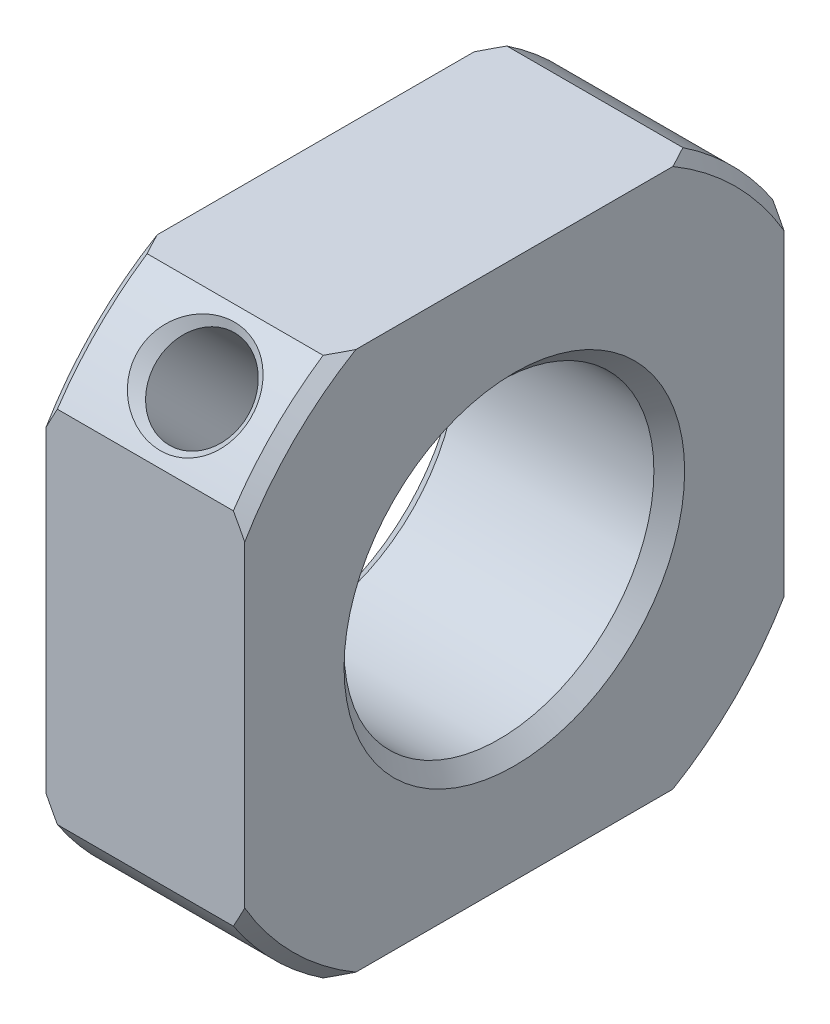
ISO-10303-21;
HEADER;
FILE_DESCRIPTION(('STEP AP214'),'2;1');
FILE_NAME('part.step','',(''),(''),'','','');
FILE_SCHEMA(('AUTOMOTIVE_DESIGN { 1 0 10303 214 1 1 1 1 }'));
ENDSEC;
DATA;
#1=APPLICATION_CONTEXT('core data for automotive mechanical design processes');
#2=APPLICATION_PROTOCOL_DEFINITION('international standard','automotive_design',2000,#1);
#3=PRODUCT_CONTEXT('',#1,'mechanical');
#4=PRODUCT('Part','Part','',(#3));
#5=PRODUCT_RELATED_PRODUCT_CATEGORY('part','',(#4));
#6=PRODUCT_DEFINITION_FORMATION('','',#4);
#7=PRODUCT_DEFINITION_CONTEXT('part definition',#1,'design');
#8=PRODUCT_DEFINITION('design','',#6,#7);
#9=PRODUCT_DEFINITION_SHAPE('','',#8);
#10=(LENGTH_UNIT() NAMED_UNIT(*) SI_UNIT(.MILLI.,.METRE.));
#11=(NAMED_UNIT(*) PLANE_ANGLE_UNIT() SI_UNIT($,.RADIAN.));
#12=(NAMED_UNIT(*) SI_UNIT($,.STERADIAN.) SOLID_ANGLE_UNIT());
#13=UNCERTAINTY_MEASURE_WITH_UNIT(LENGTH_MEASURE(1.E-05),#10,'distance_accuracy_value','');
#14=(GEOMETRIC_REPRESENTATION_CONTEXT(3) GLOBAL_UNCERTAINTY_ASSIGNED_CONTEXT((#13)) GLOBAL_UNIT_ASSIGNED_CONTEXT((#10,
#11,#12)) REPRESENTATION_CONTEXT('',''));
#15=CARTESIAN_POINT('',(0.,0.,0.));
#16=DIRECTION('',(0.,0.,1.));
#17=DIRECTION('',(1.,0.,0.));
#18=AXIS2_PLACEMENT_3D('',#15,#16,#17);
#19=CARTESIAN_POINT('',(4.8,0.,0.));
#20=DIRECTION('',(0.,0.707106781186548,0.707106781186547));
#21=DIRECTION('',(0.,-0.707106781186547,0.707106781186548));
#22=AXIS2_PLACEMENT_3D('',#19,#20,#21);
#23=CYLINDRICAL_SURFACE('',#22,1.621);
#24=CARTESIAN_POINT('',(4.8,7.80700652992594,7.80700652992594));
#25=DIRECTION('',(0.,0.707106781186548,0.707106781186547));
#26=DIRECTION('',(0.,-0.707106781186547,0.707106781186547));
#27=AXIS2_PLACEMENT_3D('',#24,#25,#26);
#28=CIRCLE('',#27,1.62099999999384);
#29=CARTESIAN_POINT('',(4.8,6.66078643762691,8.95322662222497));
#30=VERTEX_POINT('',#29);
#31=EDGE_CURVE('E321',#30,#30,#28,.T.);
#32=ORIENTED_EDGE('',*,*,#31,.T.);
#33=EDGE_LOOP('',(#32));
#34=FACE_BOUND('',#33,.T.);
#35=CARTESIAN_POINT('',(4.8,4.12773583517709,4.12773583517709));
#36=DIRECTION('',(0.,-0.707106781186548,-0.707106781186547));
#37=DIRECTION('',(0.,0.707106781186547,-0.707106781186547));
#38=AXIS2_PLACEMENT_3D('',#35,#36,#37);
#39=CIRCLE('',#38,1.62099999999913);
#40=CARTESIAN_POINT('',(4.8,5.27395592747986,2.98151574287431));
#41=VERTEX_POINT('',#40);
#42=EDGE_CURVE('E817',#41,#41,#39,.T.);
#43=ORIENTED_EDGE('',*,*,#42,.T.);
#44=EDGE_LOOP('',(#43));
#45=FACE_BOUND('',#44,.T.);
#46=ADVANCED_FACE('F17',(#34,#45),#23,.F.);
#47=CARTESIAN_POINT('',(4.8,3.85974236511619,3.85974236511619));
#48=DIRECTION('',(0.,-0.707106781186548,-0.707106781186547));
#49=DIRECTION('',(0.,0.707106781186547,-0.707106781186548));
#50=AXIS2_PLACEMENT_3D('',#47,#48,#49);
#51=CONICAL_SURFACE('',#50,1.99999999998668,0.78539816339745);
#52=CARTESIAN_POINT('',(4.8,3.85974236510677,3.85974236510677));
#53=DIRECTION('',(0.,0.707106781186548,0.707106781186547));
#54=DIRECTION('',(0.,-0.707106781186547,0.707106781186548));
#55=AXIS2_PLACEMENT_3D('',#52,#53,#54);
#56=CIRCLE('',#55,2.);
#57=CARTESIAN_POINT('',(6.8,3.85974236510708,3.85974236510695));
#58=VERTEX_POINT('',#57);
#59=CARTESIAN_POINT('',(2.8,3.85974236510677,3.85974236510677));
#60=VERTEX_POINT('',#59);
#61=EDGE_CURVE('E305',#58,#60,#56,.F.);
#62=ORIENTED_EDGE('',*,*,#61,.T.);
#63=CARTESIAN_POINT('',(4.8,3.85974236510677,3.85974236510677));
#64=DIRECTION('',(0.,0.707106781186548,0.707106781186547));
#65=DIRECTION('',(0.,-0.707106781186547,0.707106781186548));
#66=AXIS2_PLACEMENT_3D('',#63,#64,#65);
#67=CIRCLE('',#66,2.);
#68=EDGE_CURVE('E314',#60,#58,#67,.F.);
#69=ORIENTED_EDGE('',*,*,#68,.T.);
#70=EDGE_LOOP('',(#62,#69));
#71=FACE_BOUND('',#70,.T.);
#72=ORIENTED_EDGE('',*,*,#42,.F.);
#73=EDGE_LOOP('',(#72));
#74=FACE_BOUND('',#73,.T.);
#75=ADVANCED_FACE('F415',(#71,#74),#51,.F.);
#76=CARTESIAN_POINT('',(0.,0.,0.));
#77=DIRECTION('',(1.,0.,0.));
#78=DIRECTION('',(0.,0.,-1.));
#79=AXIS2_PLACEMENT_3D('',#76,#77,#78);
#80=PLANE('',#79);
#81=CARTESIAN_POINT('',(0.,0.,0.));
#82=DIRECTION('',(-1.,0.,0.));
#83=DIRECTION('',(0.,0.,1.));
#84=AXIS2_PLACEMENT_3D('',#81,#82,#83);
#85=CIRCLE('',#84,5.99999999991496);
#86=CARTESIAN_POINT('',(0.,0.,5.99999999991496));
#87=VERTEX_POINT('',#86);
#88=EDGE_CURVE('E301',#87,#87,#85,.F.);
#89=ORIENTED_EDGE('',*,*,#88,.T.);
#90=EDGE_LOOP('',(#89));
#91=FACE_BOUND('',#90,.T.);
#92=CARTESIAN_POINT('',(0.,0.,0.));
#93=DIRECTION('',(-1.,0.,0.));
#94=DIRECTION('',(0.,0.,1.));
#95=AXIS2_PLACEMENT_3D('',#92,#93,#94);
#96=CIRCLE('',#95,8.5);
#97=CARTESIAN_POINT('',(0.,0.,8.5));
#98=VERTEX_POINT('',#97);
#99=EDGE_CURVE('E20',#98,#98,#96,.F.);
#100=ORIENTED_EDGE('',*,*,#99,.F.);
#101=EDGE_LOOP('',(#100));
#102=FACE_BOUND('',#101,.T.);
#103=ADVANCED_FACE('F412',(#91,#102),#80,.F.);
#104=CARTESIAN_POINT('',(8.,0.,0.));
#105=DIRECTION('',(-1.,0.,0.));
#106=DIRECTION('',(0.,0.,1.));
#107=AXIS2_PLACEMENT_3D('',#104,#105,#106);
#108=CYLINDRICAL_SURFACE('',#107,8.5);
#109=ORIENTED_EDGE('',*,*,#99,.T.);
#110=EDGE_LOOP('',(#109));
#111=FACE_BOUND('',#110,.T.);
#112=CARTESIAN_POINT('',(1.,0.,0.));
#113=DIRECTION('',(-1.,0.,0.));
#114=DIRECTION('',(0.,0.,1.));
#115=AXIS2_PLACEMENT_3D('',#112,#113,#114);
#116=CIRCLE('',#115,8.5);
#117=CARTESIAN_POINT('',(1.,0.,8.5));
#118=VERTEX_POINT('',#117);
#119=EDGE_CURVE('E158',#118,#118,#116,.T.);
#120=ORIENTED_EDGE('',*,*,#119,.T.);
#121=EDGE_LOOP('',(#120));
#122=FACE_BOUND('',#121,.T.);
#123=ADVANCED_FACE('F408',(#111,#122),#108,.T.);
#124=CARTESIAN_POINT('',(1.4,0.,0.));
#125=DIRECTION('',(1.,0.,0.));
#126=DIRECTION('',(0.,0.,-1.));
#127=AXIS2_PLACEMENT_3D('',#124,#125,#126);
#128=CONICAL_SURFACE('',#127,11.4197745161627,0.785398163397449);
#129=CARTESIAN_POINT('',(1.00000000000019,0.,0.));
#130=DIRECTION('',(1.,0.,0.));
#131=DIRECTION('',(0.,0.,-1.));
#132=AXIS2_PLACEMENT_3D('',#129,#130,#131);
#133=CIRCLE('',#132,11.0197745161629);
#134=CARTESIAN_POINT('',(1.00000000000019,-9.49999999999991,-5.58439167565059));
#135=VERTEX_POINT('',#134);
#136=CARTESIAN_POINT('',(1.00000000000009,-5.58439167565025,-9.5));
#137=VERTEX_POINT('',#136);
#138=EDGE_CURVE('E138',#135,#137,#133,.T.);
#139=ORIENTED_EDGE('',*,*,#138,.T.);
#140=CARTESIAN_POINT('',(1.4,-6.33729043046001,-9.5));
#141=CARTESIAN_POINT('',(1.38243892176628,-6.30564540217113,-9.50000000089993));
#142=CARTESIAN_POINT('',(1.36494741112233,-6.27396174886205,-9.50000000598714));
#143=CARTESIAN_POINT('',(1.33020067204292,-6.21068690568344,-9.50000001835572));
#144=CARTESIAN_POINT('',(1.31294467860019,-6.17909613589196,-9.50000002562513));
#145=CARTESIAN_POINT('',(1.27866896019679,-6.1160053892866,-9.50000003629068));
#146=CARTESIAN_POINT('',(1.26164846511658,-6.08450583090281,-9.50000003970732));
#147=CARTESIAN_POINT('',(1.2278437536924,-6.02159579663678,-9.50000004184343));
#148=CARTESIAN_POINT('',(1.21105876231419,-5.99018573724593,-9.50000004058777));
#149=CARTESIAN_POINT('',(1.17772506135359,-5.92745294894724,-9.50000003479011));
#150=CARTESIAN_POINT('',(1.16117557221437,-5.89613063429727,-9.50000003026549));
#151=CARTESIAN_POINT('',(1.12831288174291,-5.83357154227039,-9.50000002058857));
#152=CARTESIAN_POINT('',(1.1119988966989,-5.80233517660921,-9.50000001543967));
#153=CARTESIAN_POINT('',(1.07960721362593,-5.73994614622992,-9.50000000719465));
#154=CARTESIAN_POINT('',(1.06352872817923,-5.70879389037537,-9.50000000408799));
#155=CARTESIAN_POINT('',(1.03160806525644,-5.64657120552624,-9.50000000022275));
#156=CARTESIAN_POINT('',(1.01576509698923,-5.61550118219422,-9.49999999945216));
#157=CARTESIAN_POINT('',(1.,-5.58439167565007,-9.5));
#158=B_SPLINE_CURVE_WITH_KNOTS('',3,(#140,#141,#142,#143,#144,#145,#146,#147,#148,#149,#150,
#151,#152,#153,#154,#155,#156,#157),.UNSPECIFIED.,.F.,.F.,(4,2,2,2,2,2,2,2,4),(0.,
0.108573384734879,0.216562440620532,0.323973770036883,0.430814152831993,0.537090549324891,
0.642810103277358,0.747980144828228,0.852608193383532),.UNSPECIFIED.);
#159=CARTESIAN_POINT('',(1.4,-6.33729043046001,-9.5));
#160=VERTEX_POINT('',#159);
#161=EDGE_CURVE('E144',#137,#160,#158,.F.);
#162=ORIENTED_EDGE('',*,*,#161,.T.);
#163=CARTESIAN_POINT('',(1.4,0.,0.));
#164=DIRECTION('',(-1.,0.,0.));
#165=DIRECTION('',(0.,0.,1.));
#166=AXIS2_PLACEMENT_3D('',#163,#164,#165);
#167=CIRCLE('',#166,11.4197745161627);
#168=CARTESIAN_POINT('',(1.4,-9.5,-6.33729043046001));
#169=VERTEX_POINT('',#168);
#170=EDGE_CURVE('E141',#169,#160,#167,.F.);
#171=ORIENTED_EDGE('',*,*,#170,.F.);
#172=CARTESIAN_POINT('',(1.00000000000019,-9.49999999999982,-5.58439167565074));
#173=CARTESIAN_POINT('',(1.01576509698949,-9.499999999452,-5.61550118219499));
#174=CARTESIAN_POINT('',(1.03160806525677,-9.50000000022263,-5.6465712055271));
#175=CARTESIAN_POINT('',(1.06352872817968,-9.5000000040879,-5.70879389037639));
#176=CARTESIAN_POINT('',(1.07960721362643,-9.50000000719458,-5.73994614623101));
#177=CARTESIAN_POINT('',(1.11199889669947,-9.50000001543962,-5.80233517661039));
#178=CARTESIAN_POINT('',(1.12831288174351,-9.50000002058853,-5.83357154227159));
#179=CARTESIAN_POINT('',(1.16117557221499,-9.50000003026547,-5.89613063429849));
#180=CARTESIAN_POINT('',(1.17772506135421,-9.50000003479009,-5.92745294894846));
#181=CARTESIAN_POINT('',(1.21105876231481,-9.50000004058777,-5.99018573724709));
#182=CARTESIAN_POINT('',(1.227843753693,-9.50000004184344,-6.02159579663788));
#183=CARTESIAN_POINT('',(1.26164846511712,-9.50000003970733,-6.08450583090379));
#184=CARTESIAN_POINT('',(1.27866896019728,-9.50000003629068,-6.1160053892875));
#185=CARTESIAN_POINT('',(1.31294467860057,-9.50000002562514,-6.17909613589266));
#186=CARTESIAN_POINT('',(1.33020067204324,-9.50000001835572,-6.21068690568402));
#187=CARTESIAN_POINT('',(1.3649474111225,-9.50000000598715,-6.27396174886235));
#188=CARTESIAN_POINT('',(1.38243892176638,-9.50000000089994,-6.30564540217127));
#189=CARTESIAN_POINT('',(1.4,-9.5,-6.33729043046));
#190=B_SPLINE_CURVE_WITH_KNOTS('',3,(#172,#173,#174,#175,#176,#177,#178,#179,#180,#181,#182,
#183,#184,#185,#186,#187,#188,#189),.UNSPECIFIED.,.F.,.F.,(4,2,2,2,2,2,2,2,4),(0.,
0.104628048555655,0.209798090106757,0.315517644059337,0.421794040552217,0.528634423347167,
0.636045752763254,0.744034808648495,0.852608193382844),.UNSPECIFIED.);
#191=EDGE_CURVE('E132',#169,#135,#190,.F.);
#192=ORIENTED_EDGE('',*,*,#191,.T.);
#193=EDGE_LOOP('',(#139,#162,#171,#192));
#194=FACE_BOUND('',#193,.T.);
#195=ADVANCED_FACE('F137',(#194),#128,.T.);
#196=CARTESIAN_POINT('',(1.4,0.,0.));
#197=DIRECTION('',(1.,0.,0.));
#198=DIRECTION('',(0.,0.,-1.));
#199=AXIS2_PLACEMENT_3D('',#196,#197,#198);
#200=CONICAL_SURFACE('',#199,11.4197745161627,0.785398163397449);
#201=CARTESIAN_POINT('',(1.00000000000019,0.,0.));
#202=DIRECTION('',(1.,0.,0.));
#203=DIRECTION('',(0.,0.,-1.));
#204=AXIS2_PLACEMENT_3D('',#201,#202,#203);
#205=CIRCLE('',#204,11.0197745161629);
#206=CARTESIAN_POINT('',(1.00000000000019,5.58439167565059,-9.49999999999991));
#207=VERTEX_POINT('',#206);
#208=CARTESIAN_POINT('',(1.00000000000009,9.5,-5.58439167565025));
#209=VERTEX_POINT('',#208);
#210=EDGE_CURVE('E157',#207,#209,#205,.T.);
#211=ORIENTED_EDGE('',*,*,#210,.T.);
#212=CARTESIAN_POINT('',(1.4,9.5,-6.33729043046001));
#213=CARTESIAN_POINT('',(1.38243892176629,9.50000000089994,-6.30564540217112));
#214=CARTESIAN_POINT('',(1.36494741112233,9.50000000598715,-6.27396174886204));
#215=CARTESIAN_POINT('',(1.33020067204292,9.50000001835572,-6.21068690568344));
#216=CARTESIAN_POINT('',(1.31294467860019,9.50000002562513,-6.17909613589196));
#217=CARTESIAN_POINT('',(1.27866896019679,9.50000003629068,-6.1160053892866));
#218=CARTESIAN_POINT('',(1.26164846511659,9.50000003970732,-6.08450583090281));
#219=CARTESIAN_POINT('',(1.22784375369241,9.50000004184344,-6.02159579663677));
#220=CARTESIAN_POINT('',(1.2110587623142,9.50000004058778,-5.99018573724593));
#221=CARTESIAN_POINT('',(1.17772506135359,9.50000003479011,-5.92745294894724));
#222=CARTESIAN_POINT('',(1.16117557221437,9.50000003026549,-5.89613063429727));
#223=CARTESIAN_POINT('',(1.12831288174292,9.50000002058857,-5.83357154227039));
#224=CARTESIAN_POINT('',(1.1119988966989,9.50000001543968,-5.80233517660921));
#225=CARTESIAN_POINT('',(1.07960721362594,9.50000000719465,-5.73994614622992));
#226=CARTESIAN_POINT('',(1.06352872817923,9.500000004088,-5.70879389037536));
#227=CARTESIAN_POINT('',(1.03160806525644,9.50000000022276,-5.64657120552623));
#228=CARTESIAN_POINT('',(1.01576509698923,9.49999999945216,-5.61550118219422));
#229=CARTESIAN_POINT('',(1.,9.5,-5.58439167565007));
#230=B_SPLINE_CURVE_WITH_KNOTS('',3,(#212,#213,#214,#215,#216,#217,#218,#219,#220,#221,#222,
#223,#224,#225,#226,#227,#228,#229),.UNSPECIFIED.,.F.,.F.,(4,2,2,2,2,2,2,2,4),(0.,
0.108573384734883,0.216562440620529,0.323973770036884,0.430814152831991,0.537090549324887,
0.642810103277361,0.747980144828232,0.852608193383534),.UNSPECIFIED.);
#231=CARTESIAN_POINT('',(1.4,9.5,-6.33729043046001));
#232=VERTEX_POINT('',#231);
#233=EDGE_CURVE('E375',#209,#232,#230,.F.);
#234=ORIENTED_EDGE('',*,*,#233,.T.);
#235=CARTESIAN_POINT('',(1.4,0.,0.));
#236=DIRECTION('',(-1.,0.,0.));
#237=DIRECTION('',(0.,0.,1.));
#238=AXIS2_PLACEMENT_3D('',#235,#236,#237);
#239=CIRCLE('',#238,11.4197745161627);
#240=CARTESIAN_POINT('',(1.4,6.33729043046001,-9.5));
#241=VERTEX_POINT('',#240);
#242=EDGE_CURVE('E304',#241,#232,#239,.F.);
#243=ORIENTED_EDGE('',*,*,#242,.F.);
#244=CARTESIAN_POINT('',(1.00000000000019,5.58439167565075,-9.49999999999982));
#245=CARTESIAN_POINT('',(1.01576509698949,5.61550118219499,-9.499999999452));
#246=CARTESIAN_POINT('',(1.03160806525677,5.64657120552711,-9.50000000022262));
#247=CARTESIAN_POINT('',(1.06352872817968,5.70879389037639,-9.5000000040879));
#248=CARTESIAN_POINT('',(1.07960721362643,5.73994614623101,-9.50000000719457));
#249=CARTESIAN_POINT('',(1.11199889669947,5.80233517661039,-9.50000001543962));
#250=CARTESIAN_POINT('',(1.12831288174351,5.83357154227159,-9.50000002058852));
#251=CARTESIAN_POINT('',(1.16117557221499,5.89613063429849,-9.50000003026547));
#252=CARTESIAN_POINT('',(1.17772506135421,5.92745294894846,-9.50000003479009));
#253=CARTESIAN_POINT('',(1.2110587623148,5.99018573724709,-9.50000004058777));
#254=CARTESIAN_POINT('',(1.22784375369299,6.02159579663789,-9.50000004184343));
#255=CARTESIAN_POINT('',(1.26164846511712,6.08450583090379,-9.50000003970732));
#256=CARTESIAN_POINT('',(1.27866896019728,6.11600538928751,-9.50000003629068));
#257=CARTESIAN_POINT('',(1.31294467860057,6.17909613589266,-9.50000002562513));
#258=CARTESIAN_POINT('',(1.33020067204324,6.21068690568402,-9.50000001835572));
#259=CARTESIAN_POINT('',(1.3649474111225,6.27396174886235,-9.50000000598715));
#260=CARTESIAN_POINT('',(1.38243892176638,6.30564540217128,-9.50000000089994));
#261=CARTESIAN_POINT('',(1.4,6.33729043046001,-9.5));
#262=B_SPLINE_CURVE_WITH_KNOTS('',3,(#244,#245,#246,#247,#248,#249,#250,#251,#252,#253,#254,
#255,#256,#257,#258,#259,#260,#261),.UNSPECIFIED.,.F.,.F.,(4,2,2,2,2,2,2,2,4),(0.,
0.104628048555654,0.209798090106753,0.31551764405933,0.421794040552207,0.528634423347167,
0.636045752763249,0.744034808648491,0.852608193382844),.UNSPECIFIED.);
#263=EDGE_CURVE('E377',#241,#207,#262,.F.);
#264=ORIENTED_EDGE('',*,*,#263,.T.);
#265=EDGE_LOOP('',(#211,#234,#243,#264));
#266=FACE_BOUND('',#265,.T.);
#267=ADVANCED_FACE('F357',(#266),#200,.T.);
#268=CARTESIAN_POINT('',(1.4,0.,0.));
#269=DIRECTION('',(1.,0.,0.));
#270=DIRECTION('',(0.,0.,-1.));
#271=AXIS2_PLACEMENT_3D('',#268,#269,#270);
#272=CONICAL_SURFACE('',#271,11.4197745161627,0.78539816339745);
#273=CARTESIAN_POINT('',(1.00000000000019,0.,0.));
#274=DIRECTION('',(1.,0.,0.));
#275=DIRECTION('',(0.,0.,-1.));
#276=AXIS2_PLACEMENT_3D('',#273,#274,#275);
#277=CIRCLE('',#276,11.0197745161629);
#278=CARTESIAN_POINT('',(1.00000000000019,-5.58439167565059,9.49999999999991));
#279=VERTEX_POINT('',#278);
#280=CARTESIAN_POINT('',(1.00000000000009,-9.5,5.58439167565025));
#281=VERTEX_POINT('',#280);
#282=EDGE_CURVE('E271',#279,#281,#277,.T.);
#283=ORIENTED_EDGE('',*,*,#282,.T.);
#284=CARTESIAN_POINT('',(1.4,-9.5,6.33729043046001));
#285=CARTESIAN_POINT('',(1.38243892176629,-9.50000000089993,6.30564540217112));
#286=CARTESIAN_POINT('',(1.36494741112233,-9.50000000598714,6.27396174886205));
#287=CARTESIAN_POINT('',(1.33020067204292,-9.50000001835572,6.21068690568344));
#288=CARTESIAN_POINT('',(1.31294467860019,-9.50000002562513,6.17909613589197));
#289=CARTESIAN_POINT('',(1.2786689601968,-9.50000003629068,6.11600538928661));
#290=CARTESIAN_POINT('',(1.26164846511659,-9.50000003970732,6.08450583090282));
#291=CARTESIAN_POINT('',(1.22784375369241,-9.50000004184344,6.02159579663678));
#292=CARTESIAN_POINT('',(1.2110587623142,-9.50000004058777,5.99018573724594));
#293=CARTESIAN_POINT('',(1.17772506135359,-9.50000003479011,5.92745294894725));
#294=CARTESIAN_POINT('',(1.16117557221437,-9.50000003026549,5.89613063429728));
#295=CARTESIAN_POINT('',(1.12831288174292,-9.50000002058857,5.8335715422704));
#296=CARTESIAN_POINT('',(1.1119988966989,-9.50000001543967,5.80233517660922));
#297=CARTESIAN_POINT('',(1.07960721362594,-9.50000000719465,5.73994614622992));
#298=CARTESIAN_POINT('',(1.06352872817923,-9.500000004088,5.70879389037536));
#299=CARTESIAN_POINT('',(1.03160806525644,-9.50000000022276,5.64657120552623));
#300=CARTESIAN_POINT('',(1.01576509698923,-9.49999999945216,5.61550118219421));
#301=CARTESIAN_POINT('',(0.999999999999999,-9.5,5.58439167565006));
#302=B_SPLINE_CURVE_WITH_KNOTS('',3,(#284,#285,#286,#287,#288,#289,#290,#291,#292,#293,#294,
#295,#296,#297,#298,#299,#300,#301),.UNSPECIFIED.,.F.,.F.,(4,2,2,2,2,2,2,2,4),(0.,
0.108573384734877,0.216562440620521,0.323973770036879,0.430814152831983,0.53709054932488,
0.642810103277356,0.747980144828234,0.85260819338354),.UNSPECIFIED.);
#303=CARTESIAN_POINT('',(1.4,-9.5,6.33729043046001));
#304=VERTEX_POINT('',#303);
#305=EDGE_CURVE('E162',#281,#304,#302,.F.);
#306=ORIENTED_EDGE('',*,*,#305,.T.);
#307=CARTESIAN_POINT('',(1.4,0.,0.));
#308=DIRECTION('',(-1.,0.,0.));
#309=DIRECTION('',(0.,0.,1.));
#310=AXIS2_PLACEMENT_3D('',#307,#308,#309);
#311=CIRCLE('',#310,11.4197745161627);
#312=CARTESIAN_POINT('',(1.4,-6.33729043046,9.5));
#313=VERTEX_POINT('',#312);
#314=EDGE_CURVE('E264',#313,#304,#311,.F.);
#315=ORIENTED_EDGE('',*,*,#314,.F.);
#316=CARTESIAN_POINT('',(1.00000000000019,-5.58439167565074,9.49999999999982));
#317=CARTESIAN_POINT('',(1.01576509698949,-5.61550118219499,9.49999999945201));
#318=CARTESIAN_POINT('',(1.03160806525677,-5.6465712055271,9.50000000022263));
#319=CARTESIAN_POINT('',(1.06352872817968,-5.70879389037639,9.50000000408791));
#320=CARTESIAN_POINT('',(1.07960721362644,-5.73994614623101,9.50000000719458));
#321=CARTESIAN_POINT('',(1.11199889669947,-5.80233517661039,9.50000001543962));
#322=CARTESIAN_POINT('',(1.12831288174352,-5.8335715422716,9.50000002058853));
#323=CARTESIAN_POINT('',(1.161175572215,-5.8961306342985,9.50000003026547));
#324=CARTESIAN_POINT('',(1.17772506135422,-5.92745294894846,9.5000000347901));
#325=CARTESIAN_POINT('',(1.21105876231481,-5.99018573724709,9.50000004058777));
#326=CARTESIAN_POINT('',(1.227843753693,-6.02159579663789,9.50000004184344));
#327=CARTESIAN_POINT('',(1.26164846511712,-6.0845058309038,9.50000003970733));
#328=CARTESIAN_POINT('',(1.27866896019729,-6.11600538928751,9.50000003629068));
#329=CARTESIAN_POINT('',(1.31294467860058,-6.17909613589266,9.50000002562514));
#330=CARTESIAN_POINT('',(1.33020067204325,-6.21068690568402,9.50000001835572));
#331=CARTESIAN_POINT('',(1.36494741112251,-6.27396174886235,9.50000000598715));
#332=CARTESIAN_POINT('',(1.38243892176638,-6.30564540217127,9.50000000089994));
#333=CARTESIAN_POINT('',(1.4,-6.33729043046,9.5));
#334=B_SPLINE_CURVE_WITH_KNOTS('',3,(#316,#317,#318,#319,#320,#321,#322,#323,#324,#325,#326,
#327,#328,#329,#330,#331,#332,#333),.UNSPECIFIED.,.F.,.F.,(4,2,2,2,2,2,2,2,4),(0.,
0.10462804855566,0.209798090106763,0.315517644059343,0.421794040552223,0.52863442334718,
0.636045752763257,0.744034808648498,0.852608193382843),.UNSPECIFIED.);
#335=EDGE_CURVE('E362',#313,#279,#334,.F.);
#336=ORIENTED_EDGE('',*,*,#335,.T.);
#337=EDGE_LOOP('',(#283,#306,#315,#336));
#338=FACE_BOUND('',#337,.T.);
#339=ADVANCED_FACE('F349',(#338),#272,.T.);
#340=CARTESIAN_POINT('',(1.4,0.,0.));
#341=DIRECTION('',(1.,0.,0.));
#342=DIRECTION('',(0.,1.,0.));
#343=AXIS2_PLACEMENT_3D('',#340,#341,#342);
#344=CONICAL_SURFACE('',#343,11.4197745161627,0.785398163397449);
#345=CARTESIAN_POINT('',(1.4,0.,0.));
#346=DIRECTION('',(-1.,0.,0.));
#347=DIRECTION('',(0.,0.,1.));
#348=AXIS2_PLACEMENT_3D('',#345,#346,#347);
#349=CIRCLE('',#348,11.4197745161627);
#350=CARTESIAN_POINT('',(1.4,9.5,6.33729043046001));
#351=VERTEX_POINT('',#350);
#352=CARTESIAN_POINT('',(1.4,6.33729043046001,9.5));
#353=VERTEX_POINT('',#352);
#354=EDGE_CURVE('E267',#351,#353,#349,.F.);
#355=ORIENTED_EDGE('',*,*,#354,.F.);
#356=CARTESIAN_POINT('',(1.00000000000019,9.49999999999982,5.58439167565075));
#357=CARTESIAN_POINT('',(1.01576509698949,9.499999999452,5.61550118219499));
#358=CARTESIAN_POINT('',(1.03160806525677,9.50000000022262,5.64657120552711));
#359=CARTESIAN_POINT('',(1.06352872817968,9.5000000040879,5.70879389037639));
#360=CARTESIAN_POINT('',(1.07960721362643,9.50000000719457,5.73994614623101));
#361=CARTESIAN_POINT('',(1.11199889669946,9.50000001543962,5.80233517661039));
#362=CARTESIAN_POINT('',(1.12831288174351,9.50000002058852,5.83357154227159));
#363=CARTESIAN_POINT('',(1.16117557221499,9.50000003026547,5.89613063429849));
#364=CARTESIAN_POINT('',(1.17772506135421,9.5000000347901,5.92745294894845));
#365=CARTESIAN_POINT('',(1.2110587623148,9.50000004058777,5.99018573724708));
#366=CARTESIAN_POINT('',(1.22784375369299,9.50000004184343,6.02159579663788));
#367=CARTESIAN_POINT('',(1.26164846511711,9.50000003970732,6.08450583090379));
#368=CARTESIAN_POINT('',(1.27866896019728,9.50000003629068,6.1160053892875));
#369=CARTESIAN_POINT('',(1.31294467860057,9.50000002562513,6.17909613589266));
#370=CARTESIAN_POINT('',(1.33020067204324,9.50000001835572,6.21068690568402));
#371=CARTESIAN_POINT('',(1.3649474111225,9.50000000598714,6.27396174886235));
#372=CARTESIAN_POINT('',(1.38243892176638,9.50000000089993,6.30564540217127));
#373=CARTESIAN_POINT('',(1.4,9.5,6.33729043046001));
#374=B_SPLINE_CURVE_WITH_KNOTS('',3,(#356,#357,#358,#359,#360,#361,#362,#363,#364,#365,#366,
#367,#368,#369,#370,#371,#372,#373),.UNSPECIFIED.,.F.,.F.,(4,2,2,2,2,2,2,2,4),(0.,
0.10462804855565,0.209798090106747,0.315517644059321,0.421794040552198,0.528634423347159,
0.636045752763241,0.744034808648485,0.85260819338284),.UNSPECIFIED.);
#375=CARTESIAN_POINT('',(1.00000000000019,9.49999999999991,5.58439167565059));
#376=VERTEX_POINT('',#375);
#377=EDGE_CURVE('E332',#351,#376,#374,.F.);
#378=ORIENTED_EDGE('',*,*,#377,.T.);
#379=CARTESIAN_POINT('',(1.00000000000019,0.,0.));
#380=DIRECTION('',(1.,0.,0.));
#381=DIRECTION('',(0.,1.,0.));
#382=AXIS2_PLACEMENT_3D('',#379,#380,#381);
#383=CIRCLE('',#382,11.0197745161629);
#384=CARTESIAN_POINT('',(1.00000000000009,5.58439167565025,9.5));
#385=VERTEX_POINT('',#384);
#386=EDGE_CURVE('E282',#376,#385,#383,.T.);
#387=ORIENTED_EDGE('',*,*,#386,.T.);
#388=CARTESIAN_POINT('',(1.4,6.33729043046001,9.5));
#389=CARTESIAN_POINT('',(1.38243892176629,6.30564540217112,9.50000000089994));
#390=CARTESIAN_POINT('',(1.36494741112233,6.27396174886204,9.50000000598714));
#391=CARTESIAN_POINT('',(1.33020067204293,6.21068690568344,9.50000001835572));
#392=CARTESIAN_POINT('',(1.31294467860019,6.17909613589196,9.50000002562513));
#393=CARTESIAN_POINT('',(1.2786689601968,6.11600538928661,9.50000003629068));
#394=CARTESIAN_POINT('',(1.26164846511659,6.08450583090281,9.50000003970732));
#395=CARTESIAN_POINT('',(1.22784375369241,6.02159579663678,9.50000004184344));
#396=CARTESIAN_POINT('',(1.2110587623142,5.99018573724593,9.50000004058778));
#397=CARTESIAN_POINT('',(1.17772506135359,5.92745294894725,9.50000003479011));
#398=CARTESIAN_POINT('',(1.16117557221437,5.89613063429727,9.50000003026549));
#399=CARTESIAN_POINT('',(1.12831288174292,5.83357154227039,9.50000002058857));
#400=CARTESIAN_POINT('',(1.1119988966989,5.80233517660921,9.50000001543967));
#401=CARTESIAN_POINT('',(1.07960721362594,5.73994614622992,9.50000000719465));
#402=CARTESIAN_POINT('',(1.06352872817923,5.70879389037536,9.500000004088));
#403=CARTESIAN_POINT('',(1.03160806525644,5.64657120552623,9.50000000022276));
#404=CARTESIAN_POINT('',(1.01576509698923,5.61550118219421,9.49999999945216));
#405=CARTESIAN_POINT('',(1.,5.58439167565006,9.5));
#406=B_SPLINE_CURVE_WITH_KNOTS('',3,(#388,#389,#390,#391,#392,#393,#394,#395,#396,#397,#398,
#399,#400,#401,#402,#403,#404,#405),.UNSPECIFIED.,.F.,.F.,(4,2,2,2,2,2,2,2,4),(0.,
0.108573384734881,0.216562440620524,0.32397377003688,0.430814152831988,0.537090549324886,
0.642810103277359,0.747980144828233,0.852608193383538),.UNSPECIFIED.);
#407=EDGE_CURVE('E336',#385,#353,#406,.F.);
#408=ORIENTED_EDGE('',*,*,#407,.T.);
#409=EDGE_LOOP('',(#355,#378,#387,#408));
#410=FACE_BOUND('',#409,.T.);
#411=ADVANCED_FACE('F339',(#410),#344,.T.);
#412=CARTESIAN_POINT('',(4.8,8.07661708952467,8.07661708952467));
#413=DIRECTION('',(0.,0.707106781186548,0.707106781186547));
#414=DIRECTION('',(0.,-0.707106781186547,0.707106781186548));
#415=AXIS2_PLACEMENT_3D('',#412,#413,#414);
#416=CONICAL_SURFACE('',#415,2.00228690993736,0.785398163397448);
#417=CARTESIAN_POINT('',(4.8,6.66078643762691,9.27605379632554));
#418=CARTESIAN_POINT('',(4.6811024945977,6.66079093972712,9.27605245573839));
#419=CARTESIAN_POINT('',(4.56204845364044,6.6689300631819,9.27022287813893));
#420=CARTESIAN_POINT('',(4.3271272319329,6.70126844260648,9.24687170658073));
#421=CARTESIAN_POINT('',(4.21126747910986,6.72550230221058,9.22932492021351));
#422=CARTESIAN_POINT('',(3.98648516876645,6.78921173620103,9.18255995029));
#423=CARTESIAN_POINT('',(3.8775504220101,6.82865961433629,9.15336297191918));
#424=CARTESIAN_POINT('',(3.66985716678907,6.9214998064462,9.08336140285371));
#425=CARTESIAN_POINT('',(3.57109348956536,6.9748849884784,9.04256274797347));
#426=CARTESIAN_POINT('',(3.39002346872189,7.09194271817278,8.95102957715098));
#427=CARTESIAN_POINT('',(3.30729841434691,7.15524050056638,8.90064645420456));
#428=CARTESIAN_POINT('',(3.15778201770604,7.29110255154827,8.78969476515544));
#429=CARTESIAN_POINT('',(3.09098418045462,7.36366302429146,8.72913036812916));
#430=CARTESIAN_POINT('',(2.98045499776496,7.50994562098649,8.60352140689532));
#431=CARTESIAN_POINT('',(2.93542157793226,7.58321857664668,8.53910128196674));
#432=CARTESIAN_POINT('',(2.86385819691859,7.7328203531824,8.40386042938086));
#433=CARTESIAN_POINT('',(2.83731622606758,7.80914715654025,8.33304388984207));
#434=CARTESIAN_POINT('',(2.80544582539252,7.9558055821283,8.19303659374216));
#435=CARTESIAN_POINT('',(2.79857359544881,8.026122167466,8.12417856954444));
#436=CARTESIAN_POINT('',(2.80191786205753,8.16472537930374,7.98487030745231));
#437=CARTESIAN_POINT('',(2.81213035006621,8.2330124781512,7.91442044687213));
#438=CARTESIAN_POINT('',(2.84851053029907,8.36328278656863,7.7765958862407));
#439=CARTESIAN_POINT('',(2.87411277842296,8.42540247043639,7.70919925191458));
#440=CARTESIAN_POINT('',(2.93972663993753,8.54451994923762,7.57696223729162));
#441=CARTESIAN_POINT('',(2.97973999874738,8.60151712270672,7.51212216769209));
#442=CARTESIAN_POINT('',(3.07426275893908,8.71118042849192,7.38470674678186));
#443=CARTESIAN_POINT('',(3.12921135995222,8.76363854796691,7.32227918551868));
#444=CARTESIAN_POINT('',(3.25105942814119,8.86130959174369,7.20377337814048));
#445=CARTESIAN_POINT('',(3.31796150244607,8.90652093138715,7.14769652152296));
#446=CARTESIAN_POINT('',(3.46716039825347,8.9924104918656,7.03938492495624));
#447=CARTESIAN_POINT('',(3.55023458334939,9.03249634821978,6.98775168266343));
#448=CARTESIAN_POINT('',(3.72557509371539,9.10363873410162,6.89481307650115));
#449=CARTESIAN_POINT('',(3.8178484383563,9.13468829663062,6.85351568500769));
#450=CARTESIAN_POINT('',(4.01629361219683,9.18962012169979,6.77970599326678));
#451=CARTESIAN_POINT('',(4.12298872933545,9.21279677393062,6.748076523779));
#452=CARTESIAN_POINT('',(4.34115162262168,9.24854065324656,6.69900570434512));
#453=CARTESIAN_POINT('',(4.45261069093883,9.26112643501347,6.68153954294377));
#454=CARTESIAN_POINT('',(4.60396787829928,9.27097719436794,6.66785133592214));
#455=CARTESIAN_POINT('',(4.64309888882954,9.27288042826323,6.66520396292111));
#456=CARTESIAN_POINT('',(4.72148090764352,9.27541895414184,6.66167076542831));
#457=CARTESIAN_POINT('',(4.76073191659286,9.27605423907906,6.66078495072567));
#458=CARTESIAN_POINT('',(4.9188975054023,9.27605245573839,6.66079093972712));
#459=CARTESIAN_POINT('',(5.03795154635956,9.27022287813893,6.6689300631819));
#460=CARTESIAN_POINT('',(5.27287276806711,9.24687170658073,6.70126844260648));
#461=CARTESIAN_POINT('',(5.38873252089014,9.22932492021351,6.72550230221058));
#462=CARTESIAN_POINT('',(5.61351483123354,9.18255995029,6.78921173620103));
#463=CARTESIAN_POINT('',(5.72244957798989,9.15336297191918,6.82865961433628));
#464=CARTESIAN_POINT('',(5.93014283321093,9.08336140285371,6.9214998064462));
#465=CARTESIAN_POINT('',(6.02890651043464,9.04256274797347,6.9748849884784));
#466=CARTESIAN_POINT('',(6.20997653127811,8.95102957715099,7.09194271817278));
#467=CARTESIAN_POINT('',(6.29270158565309,8.90064645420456,7.15524050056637));
#468=CARTESIAN_POINT('',(6.44221798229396,8.78969476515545,7.29110255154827));
#469=CARTESIAN_POINT('',(6.50901581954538,8.72913036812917,7.36366302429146));
#470=CARTESIAN_POINT('',(6.61954500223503,8.60352140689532,7.50994562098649));
#471=CARTESIAN_POINT('',(6.66457842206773,8.53910128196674,7.58321857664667));
#472=CARTESIAN_POINT('',(6.73614180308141,8.40386042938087,7.73282035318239));
#473=CARTESIAN_POINT('',(6.76268377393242,8.33304388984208,7.80914715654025));
#474=CARTESIAN_POINT('',(6.79455417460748,8.19303659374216,7.95580558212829));
#475=CARTESIAN_POINT('',(6.80142640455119,8.12417856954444,8.026122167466));
#476=CARTESIAN_POINT('',(6.79808213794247,7.98487030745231,8.16472537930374));
#477=CARTESIAN_POINT('',(6.78786964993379,7.91442044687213,8.2330124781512));
#478=CARTESIAN_POINT('',(6.75148946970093,7.7765958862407,8.36328278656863));
#479=CARTESIAN_POINT('',(6.72588722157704,7.70919925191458,8.42540247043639));
#480=CARTESIAN_POINT('',(6.66027336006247,7.57696223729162,8.54451994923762));
#481=CARTESIAN_POINT('',(6.62026000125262,7.51212216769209,8.60151712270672));
#482=CARTESIAN_POINT('',(6.52573724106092,7.38470674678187,8.71118042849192));
#483=CARTESIAN_POINT('',(6.47078864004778,7.32227918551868,8.76363854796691));
#484=CARTESIAN_POINT('',(6.34894057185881,7.20377337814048,8.86130959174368));
#485=CARTESIAN_POINT('',(6.28203849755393,7.14769652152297,8.90652093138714));
#486=CARTESIAN_POINT('',(6.13283960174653,7.03938492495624,8.99241049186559));
#487=CARTESIAN_POINT('',(6.04976541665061,6.98775168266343,9.03249634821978));
#488=CARTESIAN_POINT('',(5.87442490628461,6.89481307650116,9.10363873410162));
#489=CARTESIAN_POINT('',(5.7821515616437,6.8535156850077,9.13468829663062));
#490=CARTESIAN_POINT('',(5.58370638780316,6.77970599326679,9.18962012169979));
#491=CARTESIAN_POINT('',(5.47701127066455,6.748076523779,9.21279677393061));
#492=CARTESIAN_POINT('',(5.25884837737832,6.69900570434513,9.24854065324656));
#493=CARTESIAN_POINT('',(5.14738930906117,6.68153954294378,9.26112643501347));
#494=CARTESIAN_POINT('',(4.99603212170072,6.66785133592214,9.27097719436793));
#495=CARTESIAN_POINT('',(4.95690111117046,6.66520396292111,9.27288042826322));
#496=CARTESIAN_POINT('',(4.87851909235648,6.66167076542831,9.27541895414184));
#497=CARTESIAN_POINT('',(4.83926808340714,6.66078495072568,9.27605423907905));
#498=CARTESIAN_POINT('',(4.8,6.66078643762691,9.27605379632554));
#499=B_SPLINE_CURVE_WITH_KNOTS('',3,(#417,#418,#419,#420,#421,#422,#423,#424,#425,#426,#427,
#428,#429,#430,#431,#432,#433,#434,#435,#436,#437,#438,#439,#440,#441,#442,#443,#444,#445,#446,
#447,#448,#449,#450,#451,#452,#453,#454,#455,#456,#457,#458,#459,#460,#461,#462,#463,#464,#465,
#466,#467,#468,#469,#470,#471,#472,#473,#474,#475,#476,#477,#478,#479,#480,#481,#482,#483,#484,
#485,#486,#487,#488,#489,#490,#491,#492,#493,#494,#495,#496,#497,#498),.UNSPECIFIED.,.T.,.F.,(4,
2,2,2,2,2,2,2,2,2,2,2,2,2,2,2,2,2,2,2,2,2,2,2,2,2,2,2,2,2,2,2,2,2,2,2,2,2,2,2,4),(0.,
0.356544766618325,0.713858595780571,1.07052500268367,1.42700925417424,1.77232326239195,
2.11749621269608,2.4381343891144,2.75856412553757,3.05304577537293,3.34745834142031,
3.63166359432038,3.91590328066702,4.20962861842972,4.50341809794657,4.81919155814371,
5.1352078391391,5.47474893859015,5.81369393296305,5.9314487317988,6.04920418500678,
6.40574895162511,6.76306278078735,7.11972918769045,7.47621343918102,7.82152744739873,
8.16670039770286,8.48733857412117,8.80776831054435,9.10224996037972,9.39666252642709,
9.68086777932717,9.96510746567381,10.2588328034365,10.5526222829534,10.8683957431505,
11.1844120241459,11.5239531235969,11.8628981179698,11.9806529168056,12.0984083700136),.UNSPECIFIED.);
#500=CARTESIAN_POINT('',(4.8,6.66078643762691,9.27605379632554));
#501=VERTEX_POINT('',#500);
#502=EDGE_CURVE('E270',#501,#501,#499,.T.);
#503=ORIENTED_EDGE('',*,*,#502,.F.);
#504=EDGE_LOOP('',(#503));
#505=FACE_BOUND('',#504,.T.);
#506=ORIENTED_EDGE('',*,*,#31,.F.);
#507=EDGE_LOOP('',(#506));
#508=FACE_BOUND('',#507,.T.);
#509=ADVANCED_FACE('F348',(#505,#508),#416,.F.);
#510=CARTESIAN_POINT('',(4.8,0.,0.));
#511=DIRECTION('',(0.,0.707106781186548,0.707106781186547));
#512=DIRECTION('',(0.,-0.707106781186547,0.707106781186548));
#513=AXIS2_PLACEMENT_3D('',#510,#511,#512);
#514=CYLINDRICAL_SURFACE('',#513,2.);
#515=ORIENTED_EDGE('',*,*,#68,.F.);
#516=CARTESIAN_POINT('',(2.8,3.85974236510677,3.85974236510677));
#517=CARTESIAN_POINT('',(2.79999272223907,3.89816570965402,3.82132968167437));
#518=CARTESIAN_POINT('',(2.8022137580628,3.93600161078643,3.7823361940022));
#519=CARTESIAN_POINT('',(2.81105593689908,4.01024725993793,3.70351832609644));
#520=CARTESIAN_POINT('',(2.81767592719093,4.04665737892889,3.66369416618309));
#521=CARTESIAN_POINT('',(2.83523262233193,4.11771160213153,3.58364797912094));
#522=CARTESIAN_POINT('',(2.84615604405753,4.15236077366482,3.54342754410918));
#523=CARTESIAN_POINT('',(2.8722053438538,4.21981743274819,3.46282117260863));
#524=CARTESIAN_POINT('',(2.88733136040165,4.25262485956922,3.42243523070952));
#525=CARTESIAN_POINT('',(2.93880826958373,4.3480123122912,3.30158978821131));
#526=CARTESIAN_POINT('',(2.98128383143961,4.40766021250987,3.22132608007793));
#527=CARTESIAN_POINT('',(3.08117909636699,4.51829142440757,3.06423486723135));
#528=CARTESIAN_POINT('',(3.13860791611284,4.56926941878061,2.98740949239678));
#529=CARTESIAN_POINT('',(3.26922721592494,4.66412176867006,2.83714080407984));
#530=CARTESIAN_POINT('',(3.34291766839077,4.70766781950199,2.7639242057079));
#531=CARTESIAN_POINT('',(3.50290671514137,4.78548047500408,2.62690360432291));
#532=CARTESIAN_POINT('',(3.58920924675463,4.81974417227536,2.56310255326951));
#533=CARTESIAN_POINT('',(3.77576727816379,4.88042468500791,2.44565171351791));
#534=CARTESIAN_POINT('',(3.87641343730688,4.90651433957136,2.3924504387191));
#535=CARTESIAN_POINT('',(4.08651663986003,4.94951460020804,2.30218293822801));
#536=CARTESIAN_POINT('',(4.19596998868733,4.96642903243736,2.26510998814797));
#537=CARTESIAN_POINT('',(4.41604719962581,4.99090841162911,2.21063807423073));
#538=CARTESIAN_POINT('',(4.52645403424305,4.99881628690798,2.19251980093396));
#539=CARTESIAN_POINT('',(4.74900884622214,5.00659986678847,2.17469173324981));
#540=CARTESIAN_POINT('',(4.86115616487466,5.00647853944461,2.17497513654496));
#541=CARTESIAN_POINT('',(5.07723725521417,4.99844461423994,2.19336594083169));
#542=CARTESIAN_POINT('',(5.18127609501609,4.99097434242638,2.21046141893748));
#543=CARTESIAN_POINT('',(5.38484283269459,4.96877595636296,2.25991474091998));
#544=CARTESIAN_POINT('',(5.48437014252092,4.95404689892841,2.29227456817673));
#545=CARTESIAN_POINT('',(5.67823743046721,4.9167688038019,2.37118837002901));
#546=CARTESIAN_POINT('',(5.77244850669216,4.89408106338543,2.41799220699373));
#547=CARTESIAN_POINT('',(5.95159210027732,4.84062866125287,2.52329462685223));
#548=CARTESIAN_POINT('',(6.03652149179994,4.80986129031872,2.58179713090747));
#549=CARTESIAN_POINT('',(6.20039569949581,4.73767793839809,2.71210536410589));
#550=CARTESIAN_POINT('',(6.27861210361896,4.69570745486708,2.78452201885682));
#551=CARTESIAN_POINT('',(6.42059300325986,4.60196390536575,2.9368586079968));
#552=CARTESIAN_POINT('',(6.48435344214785,4.5501880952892,3.01678063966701));
#553=CARTESIAN_POINT('',(6.59637915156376,4.43609957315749,3.18221322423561));
#554=CARTESIAN_POINT('',(6.64440389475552,4.37364369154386,3.26778846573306));
#555=CARTESIAN_POINT('',(6.72187359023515,4.23949904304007,3.44001753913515));
#556=CARTESIAN_POINT('',(6.75134635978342,4.16782429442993,3.52666955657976));
#557=CARTESIAN_POINT('',(6.78061331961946,4.0552594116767,3.65421289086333));
#558=CARTESIAN_POINT('',(6.78787852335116,4.0172008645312,3.69601552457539));
#559=CARTESIAN_POINT('',(6.79756975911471,3.93956116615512,3.77866353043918));
#560=CARTESIAN_POINT('',(6.8000015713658,3.89998189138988,3.81950998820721));
#561=CARTESIAN_POINT('',(6.8,3.8597423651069,3.85974236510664));
#562=B_SPLINE_CURVE_WITH_KNOTS('',3,(#516,#517,#518,#519,#520,#521,#522,#523,#524,#525,#526,
#527,#528,#529,#530,#531,#532,#533,#534,#535,#536,#537,#538,#539,#540,#541,#542,#543,#544,#545,
#546,#547,#548,#549,#550,#551,#552,#553,#554,#555,#556,#557,#558,#559,#560,#561),.UNSPECIFIED.,
.F.,.F.,(4,2,2,2,2,2,2,2,2,2,2,2,2,2,2,2,2,2,2,2,2,2,4),(0.,0.162934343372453,0.325826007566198,
0.488218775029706,0.650616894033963,0.974946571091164,1.29947444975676,1.63588075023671,
1.97239229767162,2.32102698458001,2.66951617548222,3.00423941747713,3.33883892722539,
3.65445931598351,3.97012072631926,4.29158170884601,4.61315061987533,4.95525275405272,
5.2974507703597,5.64465880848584,5.99134498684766,6.16213338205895,6.33271740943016),.UNSPECIFIED.);
#563=EDGE_CURVE('E279',#60,#58,#562,.T.);
#564=ORIENTED_EDGE('',*,*,#563,.T.);
#565=EDGE_LOOP('',(#515,#564));
#566=FACE_BOUND('',#565,.T.);
#567=ADVANCED_FACE('F504',(#566),#514,.F.);
#568=CARTESIAN_POINT('',(4.8,0.,0.));
#569=DIRECTION('',(0.,0.707106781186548,0.707106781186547));
#570=DIRECTION('',(0.,-0.707106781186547,0.707106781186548));
#571=AXIS2_PLACEMENT_3D('',#568,#569,#570);
#572=CYLINDRICAL_SURFACE('',#571,2.);
#573=CARTESIAN_POINT('',(6.8,3.8597423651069,3.85974236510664));
#574=CARTESIAN_POINT('',(6.80000727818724,3.82132957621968,3.89816581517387));
#575=CARTESIAN_POINT('',(6.79778622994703,3.78233597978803,3.93600181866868));
#576=CARTESIAN_POINT('',(6.7889440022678,3.70351789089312,4.01024766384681));
#577=CARTESIAN_POINT('',(6.78232397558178,3.66369361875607,4.04665787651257));
#578=CARTESIAN_POINT('',(6.76476723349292,3.58364742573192,4.11771208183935));
#579=CARTESIAN_POINT('',(6.7538438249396,3.5434270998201,4.15236115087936));
#580=CARTESIAN_POINT('',(6.72779457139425,3.46282094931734,4.21981761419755));
#581=CARTESIAN_POINT('',(6.71266858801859,3.42243511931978,4.25262494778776));
#582=CARTESIAN_POINT('',(6.66119131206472,3.3015887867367,4.34801310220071));
#583=CARTESIAN_POINT('',(6.61871515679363,3.22132408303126,4.40766169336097));
#584=CARTESIAN_POINT('',(6.51881942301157,3.06423294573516,4.51829270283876));
#585=CARTESIAN_POINT('',(6.46139109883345,2.98740855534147,4.56927002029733));
#586=CARTESIAN_POINT('',(6.33077840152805,2.83714706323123,4.66411780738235));
#587=CARTESIAN_POINT('',(6.25709508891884,2.76393622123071,4.7076606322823));
#588=CARTESIAN_POINT('',(6.09710670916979,2.62691401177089,4.78547493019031));
#589=CARTESIAN_POINT('',(6.01079565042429,2.56310713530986,4.81974197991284));
#590=CARTESIAN_POINT('',(5.82419237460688,2.44562475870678,4.88043842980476));
#591=CARTESIAN_POINT('',(5.72350551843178,2.39240274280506,4.90653702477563));
#592=CARTESIAN_POINT('',(5.51337325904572,2.30214849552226,4.94953103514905));
#593=CARTESIAN_POINT('',(5.40393961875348,2.26509493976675,4.96643857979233));
#594=CARTESIAN_POINT('',(5.21170996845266,2.21750309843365,4.98782131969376));
#595=CARTESIAN_POINT('',(5.13025381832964,2.20241124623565,4.99446973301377));
#596=CARTESIAN_POINT('',(4.96587484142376,2.18221323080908,5.00332788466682));
#597=CARTESIAN_POINT('',(4.8829521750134,2.17710598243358,5.00553810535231));
#598=CARTESIAN_POINT('',(4.69187699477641,2.1771172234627,5.0055378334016));
#599=CARTESIAN_POINT('',(4.58370385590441,2.18580883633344,5.00178242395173));
#600=CARTESIAN_POINT('',(4.37054996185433,2.22001219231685,4.98669243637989));
#601=CARTESIAN_POINT('',(4.26557205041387,2.24553848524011,4.97535130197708));
#602=CARTESIAN_POINT('',(4.06203205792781,2.31173022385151,4.94494057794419));
#603=CARTESIAN_POINT('',(3.96345366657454,2.3523552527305,4.92589160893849));
#604=CARTESIAN_POINT('',(3.77475260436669,2.446574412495,4.87977833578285));
#605=CARTESIAN_POINT('',(3.68463131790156,2.50017066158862,4.85271272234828));
#606=CARTESIAN_POINT('',(3.51110949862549,2.62044938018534,4.78887152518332));
#607=CARTESIAN_POINT('',(3.42816658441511,2.68759662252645,4.75172744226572));
#608=CARTESIAN_POINT('',(3.27550163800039,2.83052386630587,4.66799841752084));
#609=CARTESIAN_POINT('',(3.20578278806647,2.90630593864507,4.62141120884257));
#610=CARTESIAN_POINT('',(3.07935618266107,3.06613966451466,4.51701267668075));
#611=CARTESIAN_POINT('',(3.02314669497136,3.15038037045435,4.45888495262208));
#612=CARTESIAN_POINT('',(2.92868099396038,3.32154030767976,4.33288004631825));
#613=CARTESIAN_POINT('',(2.890406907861,3.40845678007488,4.26501265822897));
#614=CARTESIAN_POINT('',(2.8413856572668,3.55693763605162,4.14124648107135));
#615=CARTESIAN_POINT('',(2.82590999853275,3.61870042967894,4.08741283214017));
#616=CARTESIAN_POINT('',(2.8052002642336,3.74067580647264,3.97611434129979));
#617=CARTESIAN_POINT('',(2.79996885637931,3.80088798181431,3.91864855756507));
#618=CARTESIAN_POINT('',(2.8,3.85974236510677,3.85974236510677));
#619=B_SPLINE_CURVE_WITH_KNOTS('',3,(#573,#574,#575,#576,#577,#578,#579,#580,#581,#582,#583,
#584,#585,#586,#587,#588,#589,#590,#591,#592,#593,#594,#595,#596,#597,#598,#599,#600,#601,#602,
#603,#604,#605,#606,#607,#608,#609,#610,#611,#612,#613,#614,#615,#616,#617,#618),.UNSPECIFIED.,
.F.,.F.,(4,2,2,2,2,2,2,2,2,2,2,2,2,2,2,2,2,2,2,2,2,2,4),(0.,0.162934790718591,0.325826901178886,
0.488219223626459,0.65061689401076,0.974950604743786,1.29947444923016,1.63585331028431,
1.97239229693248,2.32118495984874,2.6695162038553,2.91815705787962,3.16677088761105,
3.49082356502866,3.81515668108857,4.13862779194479,4.4621517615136,4.79963175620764,
5.13719286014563,5.485758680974,5.8339764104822,6.08342736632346,6.33294327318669),.UNSPECIFIED.);
#620=EDGE_CURVE('E459',#58,#60,#619,.T.);
#621=ORIENTED_EDGE('',*,*,#620,.T.);
#622=ORIENTED_EDGE('',*,*,#61,.F.);
#623=EDGE_LOOP('',(#621,#622));
#624=FACE_BOUND('',#623,.T.);
#625=ADVANCED_FACE('F469',(#624),#572,.F.);
#626=CARTESIAN_POINT('',(0.,0.,0.));
#627=DIRECTION('',(-1.,0.,0.));
#628=DIRECTION('',(0.,0.,1.));
#629=AXIS2_PLACEMENT_3D('',#626,#627,#628);
#630=CONICAL_SURFACE('',#629,5.99999999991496,0.785398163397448);
#631=ORIENTED_EDGE('',*,*,#88,.F.);
#632=EDGE_LOOP('',(#631));
#633=FACE_BOUND('',#632,.T.);
#634=CARTESIAN_POINT('',(0.5415,0.,0.));
#635=DIRECTION('',(-1.,0.,0.));
#636=DIRECTION('',(0.,0.,1.));
#637=AXIS2_PLACEMENT_3D('',#634,#635,#636);
#638=CIRCLE('',#637,5.4585);
#639=CARTESIAN_POINT('',(0.5415,0.,5.4585));
#640=VERTEX_POINT('',#639);
#641=EDGE_CURVE('E204',#640,#640,#638,.F.);
#642=ORIENTED_EDGE('',*,*,#641,.T.);
#643=EDGE_LOOP('',(#642));
#644=FACE_BOUND('',#643,.T.);
#645=ADVANCED_FACE('F497',(#633,#644),#630,.F.);
#646=CARTESIAN_POINT('',(8.,0.,0.));
#647=DIRECTION('',(-1.,0.,0.));
#648=DIRECTION('',(0.,0.,1.));
#649=AXIS2_PLACEMENT_3D('',#646,#647,#648);
#650=CYLINDRICAL_SURFACE('',#649,11.4197745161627);
#651=ORIENTED_EDGE('',*,*,#242,.T.);
#652=DIRECTION('',(1.,0.,0.));
#653=VECTOR('',#652,1.);
#654=CARTESIAN_POINT('',(8.,9.5,-6.33729043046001));
#655=LINE('',#654,#653);
#656=CARTESIAN_POINT('',(7.6,9.5,-6.33729043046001));
#657=VERTEX_POINT('',#656);
#658=EDGE_CURVE('E191',#232,#657,#655,.T.);
#659=ORIENTED_EDGE('',*,*,#658,.T.);
#660=CARTESIAN_POINT('',(7.6,0.,0.));
#661=DIRECTION('',(-1.,0.,0.));
#662=DIRECTION('',(0.,0.,1.));
#663=AXIS2_PLACEMENT_3D('',#660,#661,#662);
#664=CIRCLE('',#663,11.4197745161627);
#665=CARTESIAN_POINT('',(7.6,6.33729043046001,-9.5));
#666=VERTEX_POINT('',#665);
#667=EDGE_CURVE('E195',#666,#657,#664,.F.);
#668=ORIENTED_EDGE('',*,*,#667,.F.);
#669=DIRECTION('',(1.,0.,0.));
#670=VECTOR('',#669,1.);
#671=CARTESIAN_POINT('',(8.,6.33729043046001,-9.5));
#672=LINE('',#671,#670);
#673=EDGE_CURVE('E186',#666,#241,#672,.F.);
#674=ORIENTED_EDGE('',*,*,#673,.T.);
#675=EDGE_LOOP('',(#651,#659,#668,#674));
#676=FACE_BOUND('',#675,.T.);
#677=ADVANCED_FACE('F494',(#676),#650,.T.);
#678=CARTESIAN_POINT('',(8.,0.,0.));
#679=DIRECTION('',(-1.,0.,0.));
#680=DIRECTION('',(0.,0.,1.));
#681=AXIS2_PLACEMENT_3D('',#678,#679,#680);
#682=CYLINDRICAL_SURFACE('',#681,11.4197745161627);
#683=ORIENTED_EDGE('',*,*,#170,.T.);
#684=DIRECTION('',(1.,0.,0.));
#685=VECTOR('',#684,1.);
#686=CARTESIAN_POINT('',(8.,-6.33729043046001,-9.5));
#687=LINE('',#686,#685);
#688=CARTESIAN_POINT('',(7.6,-6.33729043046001,-9.5));
#689=VERTEX_POINT('',#688);
#690=EDGE_CURVE('E179',#160,#689,#687,.T.);
#691=ORIENTED_EDGE('',*,*,#690,.T.);
#692=CARTESIAN_POINT('',(7.6,0.,0.));
#693=DIRECTION('',(-1.,0.,0.));
#694=DIRECTION('',(0.,0.,1.));
#695=AXIS2_PLACEMENT_3D('',#692,#693,#694);
#696=CIRCLE('',#695,11.4197745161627);
#697=CARTESIAN_POINT('',(7.6,-9.5,-6.33729043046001));
#698=VERTEX_POINT('',#697);
#699=EDGE_CURVE('E183',#698,#689,#696,.F.);
#700=ORIENTED_EDGE('',*,*,#699,.F.);
#701=DIRECTION('',(1.,0.,0.));
#702=VECTOR('',#701,1.);
#703=CARTESIAN_POINT('',(8.,-9.5,-6.33729043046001));
#704=LINE('',#703,#702);
#705=EDGE_CURVE('E166',#698,#169,#704,.F.);
#706=ORIENTED_EDGE('',*,*,#705,.T.);
#707=EDGE_LOOP('',(#683,#691,#700,#706));
#708=FACE_BOUND('',#707,.T.);
#709=ADVANCED_FACE('F490',(#708),#682,.T.);
#710=CARTESIAN_POINT('',(8.,0.,0.));
#711=DIRECTION('',(-1.,0.,0.));
#712=DIRECTION('',(0.,0.,1.));
#713=AXIS2_PLACEMENT_3D('',#710,#711,#712);
#714=CYLINDRICAL_SURFACE('',#713,11.4197745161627);
#715=ORIENTED_EDGE('',*,*,#314,.T.);
#716=DIRECTION('',(1.,0.,0.));
#717=VECTOR('',#716,1.);
#718=CARTESIAN_POINT('',(8.,-9.5,6.33729043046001));
#719=LINE('',#718,#717);
#720=CARTESIAN_POINT('',(7.6,-9.5,6.33729043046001));
#721=VERTEX_POINT('',#720);
#722=EDGE_CURVE('E165',#304,#721,#719,.T.);
#723=ORIENTED_EDGE('',*,*,#722,.T.);
#724=CARTESIAN_POINT('',(7.6,0.,0.));
#725=DIRECTION('',(-1.,0.,0.));
#726=DIRECTION('',(0.,0.,1.));
#727=AXIS2_PLACEMENT_3D('',#724,#725,#726);
#728=CIRCLE('',#727,11.4197745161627);
#729=CARTESIAN_POINT('',(7.6,-6.33729043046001,9.5));
#730=VERTEX_POINT('',#729);
#731=EDGE_CURVE('E173',#730,#721,#728,.F.);
#732=ORIENTED_EDGE('',*,*,#731,.F.);
#733=DIRECTION('',(-1.,0.,0.));
#734=VECTOR('',#733,1.);
#735=CARTESIAN_POINT('',(8.,-6.33729043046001,9.5));
#736=LINE('',#735,#734);
#737=EDGE_CURVE('E256',#730,#313,#736,.T.);
#738=ORIENTED_EDGE('',*,*,#737,.T.);
#739=EDGE_LOOP('',(#715,#723,#732,#738));
#740=FACE_BOUND('',#739,.T.);
#741=ADVANCED_FACE('F487',(#740),#714,.T.);
#742=CARTESIAN_POINT('',(1.,8.5,0.));
#743=DIRECTION('',(1.,0.,0.));
#744=DIRECTION('',(0.,0.,-1.));
#745=AXIS2_PLACEMENT_3D('',#742,#743,#744);
#746=PLANE('',#745);
#747=DIRECTION('',(0.,1.,0.));
#748=VECTOR('',#747,1.);
#749=CARTESIAN_POINT('',(0.999999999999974,9.5,9.5));
#750=LINE('',#749,#748);
#751=EDGE_CURVE('E538',#279,#385,#750,.T.);
#752=ORIENTED_EDGE('',*,*,#751,.T.);
#753=ORIENTED_EDGE('',*,*,#386,.F.);
#754=DIRECTION('',(0.,0.,-1.));
#755=VECTOR('',#754,1.);
#756=CARTESIAN_POINT('',(0.999999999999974,9.5,-9.5));
#757=LINE('',#756,#755);
#758=EDGE_CURVE('E196',#376,#209,#757,.T.);
#759=ORIENTED_EDGE('',*,*,#758,.T.);
#760=ORIENTED_EDGE('',*,*,#210,.F.);
#761=DIRECTION('',(0.,1.,0.));
#762=VECTOR('',#761,1.);
#763=CARTESIAN_POINT('',(0.999999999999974,-9.5,-9.5));
#764=LINE('',#763,#762);
#765=EDGE_CURVE('E155',#207,#137,#764,.F.);
#766=ORIENTED_EDGE('',*,*,#765,.T.);
#767=ORIENTED_EDGE('',*,*,#138,.F.);
#768=DIRECTION('',(0.,0.,1.));
#769=VECTOR('',#768,1.);
#770=CARTESIAN_POINT('',(0.999999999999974,-9.5,9.5));
#771=LINE('',#770,#769);
#772=EDGE_CURVE('E152',#135,#281,#771,.T.);
#773=ORIENTED_EDGE('',*,*,#772,.T.);
#774=ORIENTED_EDGE('',*,*,#282,.F.);
#775=EDGE_LOOP('',(#752,#753,#759,#760,#766,#767,#773,#774));
#776=FACE_BOUND('',#775,.T.);
#777=ORIENTED_EDGE('',*,*,#119,.F.);
#778=EDGE_LOOP('',(#777));
#779=FACE_BOUND('',#778,.T.);
#780=ADVANCED_FACE('F149',(#776,#779),#746,.F.);
#781=CARTESIAN_POINT('',(8.,0.,0.));
#782=DIRECTION('',(-1.,0.,0.));
#783=DIRECTION('',(0.,0.,1.));
#784=AXIS2_PLACEMENT_3D('',#781,#782,#783);
#785=CYLINDRICAL_SURFACE('',#784,11.4197745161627);
#786=ORIENTED_EDGE('',*,*,#502,.T.);
#787=EDGE_LOOP('',(#786));
#788=FACE_BOUND('',#787,.T.);
#789=CARTESIAN_POINT('',(7.6,0.,0.));
#790=DIRECTION('',(-1.,0.,0.));
#791=DIRECTION('',(0.,0.,1.));
#792=AXIS2_PLACEMENT_3D('',#789,#790,#791);
#793=CIRCLE('',#792,11.4197745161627);
#794=CARTESIAN_POINT('',(7.6,9.5,6.33729043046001));
#795=VERTEX_POINT('',#794);
#796=CARTESIAN_POINT('',(7.6,6.33729043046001,9.5));
#797=VERTEX_POINT('',#796);
#798=EDGE_CURVE('E211',#795,#797,#793,.F.);
#799=ORIENTED_EDGE('',*,*,#798,.F.);
#800=DIRECTION('',(1.,0.,0.));
#801=VECTOR('',#800,1.);
#802=CARTESIAN_POINT('',(8.,9.5,6.33729043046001));
#803=LINE('',#802,#801);
#804=EDGE_CURVE('E200',#795,#351,#803,.F.);
#805=ORIENTED_EDGE('',*,*,#804,.T.);
#806=ORIENTED_EDGE('',*,*,#354,.T.);
#807=DIRECTION('',(-1.,0.,0.));
#808=VECTOR('',#807,1.);
#809=CARTESIAN_POINT('',(8.,6.33729043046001,9.5));
#810=LINE('',#809,#808);
#811=EDGE_CURVE('E214',#353,#797,#810,.F.);
#812=ORIENTED_EDGE('',*,*,#811,.T.);
#813=EDGE_LOOP('',(#799,#805,#806,#812));
#814=FACE_BOUND('',#813,.T.);
#815=ADVANCED_FACE('F477',(#788,#814),#785,.T.);
#816=CARTESIAN_POINT('',(8.,0.,0.));
#817=DIRECTION('',(-1.,0.,0.));
#818=DIRECTION('',(0.,0.,1.));
#819=AXIS2_PLACEMENT_3D('',#816,#817,#818);
#820=CYLINDRICAL_SURFACE('',#819,5.4585);
#821=ORIENTED_EDGE('',*,*,#641,.F.);
#822=EDGE_LOOP('',(#821));
#823=FACE_BOUND('',#822,.T.);
#824=CARTESIAN_POINT('',(7.45849999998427,0.,0.));
#825=DIRECTION('',(1.,0.,0.));
#826=DIRECTION('',(0.,0.,-1.));
#827=AXIS2_PLACEMENT_3D('',#824,#825,#826);
#828=CIRCLE('',#827,5.45849999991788);
#829=CARTESIAN_POINT('',(7.45849999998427,0.,-5.45849999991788));
#830=VERTEX_POINT('',#829);
#831=EDGE_CURVE('E205',#830,#830,#828,.T.);
#832=ORIENTED_EDGE('',*,*,#831,.T.);
#833=EDGE_LOOP('',(#832));
#834=FACE_BOUND('',#833,.T.);
#835=ORIENTED_EDGE('',*,*,#620,.F.);
#836=ORIENTED_EDGE('',*,*,#563,.F.);
#837=EDGE_LOOP('',(#835,#836));
#838=FACE_BOUND('',#837,.T.);
#839=ADVANCED_FACE('F472',(#823,#834,#838),#820,.F.);
#840=CARTESIAN_POINT('',(8.,9.5,-9.5));
#841=DIRECTION('',(0.,-1.,0.));
#842=DIRECTION('',(0.,0.,-1.));
#843=AXIS2_PLACEMENT_3D('',#840,#841,#842);
#844=PLANE('',#843);
#845=ORIENTED_EDGE('',*,*,#233,.F.);
#846=ORIENTED_EDGE('',*,*,#758,.F.);
#847=ORIENTED_EDGE('',*,*,#377,.F.);
#848=ORIENTED_EDGE('',*,*,#804,.F.);
#849=CARTESIAN_POINT('',(7.6,9.5,6.33729043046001));
#850=CARTESIAN_POINT('',(7.61756107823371,9.50000000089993,6.30564540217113));
#851=CARTESIAN_POINT('',(7.63505258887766,9.50000000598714,6.27396174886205));
#852=CARTESIAN_POINT('',(7.66979932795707,9.50000001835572,6.21068690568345));
#853=CARTESIAN_POINT('',(7.6870553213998,9.50000002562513,6.17909613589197));
#854=CARTESIAN_POINT('',(7.7213310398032,9.50000003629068,6.11600538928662));
#855=CARTESIAN_POINT('',(7.7383515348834,9.50000003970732,6.08450583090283));
#856=CARTESIAN_POINT('',(7.77215624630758,9.50000004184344,6.02159579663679));
#857=CARTESIAN_POINT('',(7.78894123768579,9.50000004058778,5.99018573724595));
#858=CARTESIAN_POINT('',(7.8222749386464,9.50000003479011,5.92745294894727));
#859=CARTESIAN_POINT('',(7.83882442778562,9.50000003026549,5.89613063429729));
#860=CARTESIAN_POINT('',(7.87168711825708,9.50000002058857,5.83357154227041));
#861=CARTESIAN_POINT('',(7.88800110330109,9.50000001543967,5.80233517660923));
#862=CARTESIAN_POINT('',(7.92039278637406,9.50000000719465,5.73994614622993));
#863=CARTESIAN_POINT('',(7.93647127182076,9.500000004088,5.70879389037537));
#864=CARTESIAN_POINT('',(7.96839193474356,9.50000000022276,5.64657120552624));
#865=CARTESIAN_POINT('',(7.98423490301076,9.49999999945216,5.61550118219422));
#866=CARTESIAN_POINT('',(8.,9.5,5.58439167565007));
#867=B_SPLINE_CURVE_WITH_KNOTS('',3,(#849,#850,#851,#852,#853,#854,#855,#856,#857,#858,#859,
#860,#861,#862,#863,#864,#865,#866),.UNSPECIFIED.,.F.,.F.,(4,2,2,2,2,2,2,2,4),(0.,
0.108573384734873,0.216562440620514,0.323973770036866,0.430814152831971,0.537090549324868,
0.642810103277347,0.747980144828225,0.852608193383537),.UNSPECIFIED.);
#868=CARTESIAN_POINT('',(8.,9.5,5.58439167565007));
#869=VERTEX_POINT('',#868);
#870=EDGE_CURVE('E210',#869,#795,#867,.F.);
#871=ORIENTED_EDGE('',*,*,#870,.F.);
#872=DIRECTION('',(0.,0.,1.));
#873=VECTOR('',#872,1.);
#874=CARTESIAN_POINT('',(8.,9.5,0.));
#875=LINE('',#874,#873);
#876=CARTESIAN_POINT('',(8.,9.5,-5.58439167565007));
#877=VERTEX_POINT('',#876);
#878=EDGE_CURVE('E209',#869,#877,#875,.F.);
#879=ORIENTED_EDGE('',*,*,#878,.T.);
#880=CARTESIAN_POINT('',(8.,9.5,-5.58439167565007));
#881=CARTESIAN_POINT('',(7.98423490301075,9.49999999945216,-5.61550118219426));
#882=CARTESIAN_POINT('',(7.96839193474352,9.50000000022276,-5.64657120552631));
#883=CARTESIAN_POINT('',(7.93647127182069,9.500000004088,-5.7087938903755));
#884=CARTESIAN_POINT('',(7.92039278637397,9.50000000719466,-5.73994614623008));
#885=CARTESIAN_POINT('',(7.88800110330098,9.50000001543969,-5.80233517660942));
#886=CARTESIAN_POINT('',(7.87168711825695,9.50000002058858,-5.83357154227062));
#887=CARTESIAN_POINT('',(7.83882442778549,9.5000000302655,-5.89613063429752));
#888=CARTESIAN_POINT('',(7.82227493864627,9.50000003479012,-5.9274529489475));
#889=CARTESIAN_POINT('',(7.78894123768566,9.50000004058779,-5.99018573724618));
#890=CARTESIAN_POINT('',(7.77215624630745,9.50000004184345,-6.02159579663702));
#891=CARTESIAN_POINT('',(7.73835153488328,9.50000003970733,-6.08450583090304));
#892=CARTESIAN_POINT('',(7.72133103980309,9.50000003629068,-6.11600538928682));
#893=CARTESIAN_POINT('',(7.68705532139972,9.50000002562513,-6.17909613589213));
#894=CARTESIAN_POINT('',(7.669799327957,9.50000001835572,-6.21068690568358));
#895=CARTESIAN_POINT('',(7.63505258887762,9.50000000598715,-6.27396174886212));
#896=CARTESIAN_POINT('',(7.61756107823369,9.50000000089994,-6.30564540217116));
#897=CARTESIAN_POINT('',(7.6,9.5,-6.33729043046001));
#898=B_SPLINE_CURVE_WITH_KNOTS('',3,(#880,#881,#882,#883,#884,#885,#886,#887,#888,#889,#890,
#891,#892,#893,#894,#895,#896,#897),.UNSPECIFIED.,.F.,.F.,(4,2,2,2,2,2,2,2,4),(0.,
0.104628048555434,0.209798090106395,0.315517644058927,0.421794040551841,0.52863442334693,
0.636045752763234,0.744034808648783,0.852608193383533),.UNSPECIFIED.);
#899=EDGE_CURVE('E528',#657,#877,#898,.F.);
#900=ORIENTED_EDGE('',*,*,#899,.F.);
#901=ORIENTED_EDGE('',*,*,#658,.F.);
#902=EDGE_LOOP('',(#845,#846,#847,#848,#871,#879,#900,#901));
#903=FACE_BOUND('',#902,.T.);
#904=ADVANCED_FACE('F476',(#903),#844,.F.);
#905=CARTESIAN_POINT('',(7.6,0.,0.));
#906=DIRECTION('',(-1.,0.,0.));
#907=DIRECTION('',(0.,0.,1.));
#908=AXIS2_PLACEMENT_3D('',#905,#906,#907);
#909=CONICAL_SURFACE('',#908,11.4197745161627,0.785398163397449);
#910=ORIENTED_EDGE('',*,*,#667,.T.);
#911=ORIENTED_EDGE('',*,*,#899,.T.);
#912=CARTESIAN_POINT('',(8.,0.,0.));
#913=DIRECTION('',(-1.,0.,0.));
#914=DIRECTION('',(0.,0.,1.));
#915=AXIS2_PLACEMENT_3D('',#912,#913,#914);
#916=CIRCLE('',#915,11.0197745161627);
#917=CARTESIAN_POINT('',(8.,5.58439167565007,-9.5));
#918=VERTEX_POINT('',#917);
#919=EDGE_CURVE('E455',#877,#918,#916,.T.);
#920=ORIENTED_EDGE('',*,*,#919,.T.);
#921=CARTESIAN_POINT('',(7.6,6.33729043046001,-9.5));
#922=CARTESIAN_POINT('',(7.61756107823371,6.30564540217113,-9.50000000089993));
#923=CARTESIAN_POINT('',(7.63505258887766,6.27396174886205,-9.50000000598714));
#924=CARTESIAN_POINT('',(7.66979932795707,6.21068690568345,-9.50000001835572));
#925=CARTESIAN_POINT('',(7.6870553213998,6.17909613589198,-9.50000002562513));
#926=CARTESIAN_POINT('',(7.7213310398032,6.11600538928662,-9.50000003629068));
#927=CARTESIAN_POINT('',(7.7383515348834,6.08450583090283,-9.50000003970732));
#928=CARTESIAN_POINT('',(7.77215624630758,6.02159579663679,-9.50000004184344));
#929=CARTESIAN_POINT('',(7.78894123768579,5.99018573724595,-9.50000004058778));
#930=CARTESIAN_POINT('',(7.8222749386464,5.92745294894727,-9.50000003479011));
#931=CARTESIAN_POINT('',(7.83882442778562,5.89613063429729,-9.50000003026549));
#932=CARTESIAN_POINT('',(7.87168711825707,5.83357154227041,-9.50000002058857));
#933=CARTESIAN_POINT('',(7.88800110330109,5.80233517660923,-9.50000001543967));
#934=CARTESIAN_POINT('',(7.92039278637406,5.73994614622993,-9.50000000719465));
#935=CARTESIAN_POINT('',(7.93647127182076,5.70879389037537,-9.500000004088));
#936=CARTESIAN_POINT('',(7.96839193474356,5.64657120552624,-9.50000000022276));
#937=CARTESIAN_POINT('',(7.98423490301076,5.61550118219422,-9.49999999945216));
#938=CARTESIAN_POINT('',(8.,5.58439167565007,-9.5));
#939=B_SPLINE_CURVE_WITH_KNOTS('',3,(#921,#922,#923,#924,#925,#926,#927,#928,#929,#930,#931,
#932,#933,#934,#935,#936,#937,#938),.UNSPECIFIED.,.F.,.F.,(4,2,2,2,2,2,2,2,4),(0.,
0.108573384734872,0.216562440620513,0.323973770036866,0.430814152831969,0.537090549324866,
0.642810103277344,0.747980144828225,0.852608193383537),.UNSPECIFIED.);
#940=EDGE_CURVE('E190',#918,#666,#939,.F.);
#941=ORIENTED_EDGE('',*,*,#940,.T.);
#942=EDGE_LOOP('',(#910,#911,#920,#941));
#943=FACE_BOUND('',#942,.T.);
#944=ADVANCED_FACE('F560',(#943),#909,.T.);
#945=CARTESIAN_POINT('',(8.,-9.5,-9.5));
#946=DIRECTION('',(0.,0.,1.));
#947=DIRECTION('',(1.,0.,0.));
#948=AXIS2_PLACEMENT_3D('',#945,#946,#947);
#949=PLANE('',#948);
#950=ORIENTED_EDGE('',*,*,#161,.F.);
#951=ORIENTED_EDGE('',*,*,#765,.F.);
#952=ORIENTED_EDGE('',*,*,#263,.F.);
#953=ORIENTED_EDGE('',*,*,#673,.F.);
#954=ORIENTED_EDGE('',*,*,#940,.F.);
#955=DIRECTION('',(0.,1.,0.));
#956=VECTOR('',#955,1.);
#957=CARTESIAN_POINT('',(8.,11.0197745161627,-9.5));
#958=LINE('',#957,#956);
#959=CARTESIAN_POINT('',(8.,-5.58439167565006,-9.5));
#960=VERTEX_POINT('',#959);
#961=EDGE_CURVE('E454',#918,#960,#958,.F.);
#962=ORIENTED_EDGE('',*,*,#961,.T.);
#963=CARTESIAN_POINT('',(8.,-5.58439167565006,-9.5));
#964=CARTESIAN_POINT('',(7.98423490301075,-5.61550118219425,-9.49999999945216));
#965=CARTESIAN_POINT('',(7.96839193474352,-5.64657120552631,-9.50000000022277));
#966=CARTESIAN_POINT('',(7.93647127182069,-5.7087938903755,-9.50000000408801));
#967=CARTESIAN_POINT('',(7.92039278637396,-5.73994614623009,-9.50000000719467));
#968=CARTESIAN_POINT('',(7.88800110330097,-5.80233517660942,-9.50000001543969));
#969=CARTESIAN_POINT('',(7.87168711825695,-5.83357154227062,-9.50000002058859));
#970=CARTESIAN_POINT('',(7.83882442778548,-5.89613063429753,-9.50000003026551));
#971=CARTESIAN_POINT('',(7.82227493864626,-5.92745294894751,-9.50000003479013));
#972=CARTESIAN_POINT('',(7.78894123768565,-5.9901857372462,-9.50000004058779));
#973=CARTESIAN_POINT('',(7.77215624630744,-6.02159579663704,-9.50000004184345));
#974=CARTESIAN_POINT('',(7.73835153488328,-6.08450583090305,-9.50000003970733));
#975=CARTESIAN_POINT('',(7.72133103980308,-6.11600538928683,-9.50000003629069));
#976=CARTESIAN_POINT('',(7.68705532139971,-6.17909613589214,-9.50000002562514));
#977=CARTESIAN_POINT('',(7.66979932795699,-6.21068690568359,-9.50000001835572));
#978=CARTESIAN_POINT('',(7.63505258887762,-6.27396174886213,-9.50000000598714));
#979=CARTESIAN_POINT('',(7.61756107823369,-6.30564540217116,-9.50000000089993));
#980=CARTESIAN_POINT('',(7.6,-6.33729043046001,-9.5));
#981=B_SPLINE_CURVE_WITH_KNOTS('',3,(#963,#964,#965,#966,#967,#968,#969,#970,#971,#972,#973,
#974,#975,#976,#977,#978,#979,#980),.UNSPECIFIED.,.F.,.F.,(4,2,2,2,2,2,2,2,4),(0.,
0.104628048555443,0.209798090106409,0.315517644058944,0.421794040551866,0.528634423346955,
0.636045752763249,0.744034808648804,0.852608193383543),.UNSPECIFIED.);
#982=EDGE_CURVE('E524',#689,#960,#981,.F.);
#983=ORIENTED_EDGE('',*,*,#982,.F.);
#984=ORIENTED_EDGE('',*,*,#690,.F.);
#985=EDGE_LOOP('',(#950,#951,#952,#953,#954,#962,#983,#984));
#986=FACE_BOUND('',#985,.T.);
#987=ADVANCED_FACE('F554',(#986),#949,.F.);
#988=CARTESIAN_POINT('',(7.6,0.,0.));
#989=DIRECTION('',(-1.,0.,0.));
#990=DIRECTION('',(0.,-1.,0.));
#991=AXIS2_PLACEMENT_3D('',#988,#989,#990);
#992=CONICAL_SURFACE('',#991,11.4197745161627,0.785398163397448);
#993=ORIENTED_EDGE('',*,*,#699,.T.);
#994=ORIENTED_EDGE('',*,*,#982,.T.);
#995=CARTESIAN_POINT('',(8.,0.,0.));
#996=DIRECTION('',(-1.,0.,0.));
#997=DIRECTION('',(0.,-1.,0.));
#998=AXIS2_PLACEMENT_3D('',#995,#996,#997);
#999=CIRCLE('',#998,11.0197745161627);
#1000=CARTESIAN_POINT('',(8.,-9.5,-5.58439167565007));
#1001=VERTEX_POINT('',#1000);
#1002=EDGE_CURVE('E447',#960,#1001,#999,.T.);
#1003=ORIENTED_EDGE('',*,*,#1002,.T.);
#1004=CARTESIAN_POINT('',(7.6,-9.5,-6.33729043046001));
#1005=CARTESIAN_POINT('',(7.61756107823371,-9.50000000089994,-6.30564540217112));
#1006=CARTESIAN_POINT('',(7.63505258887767,-9.50000000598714,-6.27396174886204));
#1007=CARTESIAN_POINT('',(7.66979932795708,-9.50000001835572,-6.21068690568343));
#1008=CARTESIAN_POINT('',(7.68705532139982,-9.50000002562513,-6.17909613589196));
#1009=CARTESIAN_POINT('',(7.72133103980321,-9.50000003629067,-6.1160053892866));
#1010=CARTESIAN_POINT('',(7.73835153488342,-9.50000003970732,-6.0845058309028));
#1011=CARTESIAN_POINT('',(7.7721562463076,-9.50000004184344,-6.02159579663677));
#1012=CARTESIAN_POINT('',(7.78894123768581,-9.50000004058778,-5.99018573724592));
#1013=CARTESIAN_POINT('',(7.82227493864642,-9.50000003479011,-5.92745294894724));
#1014=CARTESIAN_POINT('',(7.83882442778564,-9.50000003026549,-5.89613063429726));
#1015=CARTESIAN_POINT('',(7.87168711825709,-9.50000002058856,-5.83357154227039));
#1016=CARTESIAN_POINT('',(7.88800110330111,-9.50000001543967,-5.80233517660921));
#1017=CARTESIAN_POINT('',(7.92039278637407,-9.50000000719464,-5.73994614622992));
#1018=CARTESIAN_POINT('',(7.93647127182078,-9.50000000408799,-5.70879389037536));
#1019=CARTESIAN_POINT('',(7.96839193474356,-9.50000000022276,-5.64657120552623));
#1020=CARTESIAN_POINT('',(7.98423490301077,-9.49999999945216,-5.61550118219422));
#1021=CARTESIAN_POINT('',(8.,-9.5,-5.58439167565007));
#1022=B_SPLINE_CURVE_WITH_KNOTS('',3,(#1004,#1005,#1006,#1007,#1008,#1009,#1010,#1011,#1012,
#1013,#1014,#1015,#1016,#1017,#1018,#1019,#1020,#1021),.UNSPECIFIED.,.F.,.F.,(4,2,2,2,2,2,2,2,
4),(0.,0.10857338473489,0.216562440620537,0.323973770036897,0.430814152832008,0.537090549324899,
0.642810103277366,0.747980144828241,0.852608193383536),.UNSPECIFIED.);
#1023=EDGE_CURVE('E175',#1001,#698,#1022,.F.);
#1024=ORIENTED_EDGE('',*,*,#1023,.T.);
#1025=EDGE_LOOP('',(#993,#994,#1003,#1024));
#1026=FACE_BOUND('',#1025,.T.);
#1027=ADVANCED_FACE('F568',(#1026),#992,.T.);
#1028=CARTESIAN_POINT('',(8.,-9.5,9.5));
#1029=DIRECTION('',(0.,1.,0.));
#1030=DIRECTION('',(0.,0.,1.));
#1031=AXIS2_PLACEMENT_3D('',#1028,#1029,#1030);
#1032=PLANE('',#1031);
#1033=ORIENTED_EDGE('',*,*,#305,.F.);
#1034=ORIENTED_EDGE('',*,*,#772,.F.);
#1035=ORIENTED_EDGE('',*,*,#191,.F.);
#1036=ORIENTED_EDGE('',*,*,#705,.F.);
#1037=ORIENTED_EDGE('',*,*,#1023,.F.);
#1038=DIRECTION('',(0.,0.,1.));
#1039=VECTOR('',#1038,1.);
#1040=CARTESIAN_POINT('',(8.,-9.5,0.));
#1041=LINE('',#1040,#1039);
#1042=CARTESIAN_POINT('',(8.,-9.5,5.58439167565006));
#1043=VERTEX_POINT('',#1042);
#1044=EDGE_CURVE('E444',#1001,#1043,#1041,.T.);
#1045=ORIENTED_EDGE('',*,*,#1044,.T.);
#1046=CARTESIAN_POINT('',(8.,-9.5,5.58439167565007));
#1047=CARTESIAN_POINT('',(7.98423490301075,-9.49999999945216,5.61550118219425));
#1048=CARTESIAN_POINT('',(7.96839193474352,-9.50000000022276,5.6465712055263));
#1049=CARTESIAN_POINT('',(7.9364712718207,-9.500000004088,5.70879389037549));
#1050=CARTESIAN_POINT('',(7.92039278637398,-9.50000000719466,5.73994614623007));
#1051=CARTESIAN_POINT('',(7.88800110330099,-9.50000001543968,5.8023351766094));
#1052=CARTESIAN_POINT('',(7.87168711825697,-9.50000002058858,5.83357154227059));
#1053=CARTESIAN_POINT('',(7.8388244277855,-9.5000000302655,5.8961306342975));
#1054=CARTESIAN_POINT('',(7.82227493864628,-9.50000003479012,5.92745294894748));
#1055=CARTESIAN_POINT('',(7.78894123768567,-9.50000004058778,5.99018573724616));
#1056=CARTESIAN_POINT('',(7.77215624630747,-9.50000004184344,6.021595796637));
#1057=CARTESIAN_POINT('',(7.7383515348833,-9.50000003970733,6.08450583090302));
#1058=CARTESIAN_POINT('',(7.7213310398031,-9.50000003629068,6.1160053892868));
#1059=CARTESIAN_POINT('',(7.68705532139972,-9.50000002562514,6.17909613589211));
#1060=CARTESIAN_POINT('',(7.669799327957,-9.50000001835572,6.21068690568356));
#1061=CARTESIAN_POINT('',(7.63505258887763,-9.50000000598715,6.27396174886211));
#1062=CARTESIAN_POINT('',(7.61756107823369,-9.50000000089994,6.30564540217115));
#1063=CARTESIAN_POINT('',(7.6,-9.5,6.33729043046));
#1064=B_SPLINE_CURVE_WITH_KNOTS('',3,(#1046,#1047,#1048,#1049,#1050,#1051,#1052,#1053,#1054,
#1055,#1056,#1057,#1058,#1059,#1060,#1061,#1062,#1063),.UNSPECIFIED.,.F.,.F.,(4,2,2,2,2,2,2,2,
4),(0.,0.104628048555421,0.209798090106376,0.3155176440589,0.421794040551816,0.528634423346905,
0.636045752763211,0.744034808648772,0.852608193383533),.UNSPECIFIED.);
#1065=EDGE_CURVE('E247',#721,#1043,#1064,.F.);
#1066=ORIENTED_EDGE('',*,*,#1065,.F.);
#1067=ORIENTED_EDGE('',*,*,#722,.F.);
#1068=EDGE_LOOP('',(#1033,#1034,#1035,#1036,#1037,#1045,#1066,#1067));
#1069=FACE_BOUND('',#1068,.T.);
#1070=ADVANCED_FACE('F160',(#1069),#1032,.F.);
#1071=CARTESIAN_POINT('',(7.6,0.,0.));
#1072=DIRECTION('',(-1.,0.,0.));
#1073=DIRECTION('',(0.,-1.,0.));
#1074=AXIS2_PLACEMENT_3D('',#1071,#1072,#1073);
#1075=CONICAL_SURFACE('',#1074,11.4197745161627,0.785398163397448);
#1076=ORIENTED_EDGE('',*,*,#731,.T.);
#1077=ORIENTED_EDGE('',*,*,#1065,.T.);
#1078=CARTESIAN_POINT('',(8.,0.,0.));
#1079=DIRECTION('',(-1.,0.,0.));
#1080=DIRECTION('',(0.,-1.,0.));
#1081=AXIS2_PLACEMENT_3D('',#1078,#1079,#1080);
#1082=CIRCLE('',#1081,11.0197745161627);
#1083=CARTESIAN_POINT('',(8.,-5.58439167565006,9.5));
#1084=VERTEX_POINT('',#1083);
#1085=EDGE_CURVE('E438',#1043,#1084,#1082,.T.);
#1086=ORIENTED_EDGE('',*,*,#1085,.T.);
#1087=CARTESIAN_POINT('',(7.6,-6.33729043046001,9.5));
#1088=CARTESIAN_POINT('',(7.61756107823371,-6.30564540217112,9.50000000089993));
#1089=CARTESIAN_POINT('',(7.63505258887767,-6.27396174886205,9.50000000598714));
#1090=CARTESIAN_POINT('',(7.66979932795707,-6.21068690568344,9.50000001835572));
#1091=CARTESIAN_POINT('',(7.68705532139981,-6.17909613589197,9.50000002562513));
#1092=CARTESIAN_POINT('',(7.7213310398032,-6.11600538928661,9.50000003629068));
#1093=CARTESIAN_POINT('',(7.73835153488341,-6.08450583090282,9.50000003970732));
#1094=CARTESIAN_POINT('',(7.77215624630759,-6.02159579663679,9.50000004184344));
#1095=CARTESIAN_POINT('',(7.7889412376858,-5.99018573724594,9.50000004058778));
#1096=CARTESIAN_POINT('',(7.82227493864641,-5.92745294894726,9.50000003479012));
#1097=CARTESIAN_POINT('',(7.83882442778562,-5.89613063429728,9.50000003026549));
#1098=CARTESIAN_POINT('',(7.87168711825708,-5.8335715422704,9.50000002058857));
#1099=CARTESIAN_POINT('',(7.8880011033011,-5.80233517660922,9.50000001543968));
#1100=CARTESIAN_POINT('',(7.92039278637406,-5.73994614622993,9.50000000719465));
#1101=CARTESIAN_POINT('',(7.93647127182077,-5.70879389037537,9.500000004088));
#1102=CARTESIAN_POINT('',(7.96839193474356,-5.64657120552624,9.50000000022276));
#1103=CARTESIAN_POINT('',(7.98423490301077,-5.61550118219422,9.49999999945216));
#1104=CARTESIAN_POINT('',(8.,-5.58439167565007,9.5));
#1105=B_SPLINE_CURVE_WITH_KNOTS('',3,(#1087,#1088,#1089,#1090,#1091,#1092,#1093,#1094,#1095,
#1096,#1097,#1098,#1099,#1100,#1101,#1102,#1103,#1104),.UNSPECIFIED.,.F.,.F.,(4,2,2,2,2,2,2,2,
4),(0.,0.108573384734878,0.216562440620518,0.323973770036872,0.430814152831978,
0.537090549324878,0.642810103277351,0.747980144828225,0.852608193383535),.UNSPECIFIED.);
#1106=EDGE_CURVE('E251',#1084,#730,#1105,.F.);
#1107=ORIENTED_EDGE('',*,*,#1106,.T.);
#1108=EDGE_LOOP('',(#1076,#1077,#1086,#1107));
#1109=FACE_BOUND('',#1108,.T.);
#1110=ADVANCED_FACE('F238',(#1109),#1075,.T.);
#1111=CARTESIAN_POINT('',(8.,9.5,9.5));
#1112=DIRECTION('',(0.,0.,-1.));
#1113=DIRECTION('',(-1.,0.,0.));
#1114=AXIS2_PLACEMENT_3D('',#1111,#1112,#1113);
#1115=PLANE('',#1114);
#1116=ORIENTED_EDGE('',*,*,#407,.F.);
#1117=ORIENTED_EDGE('',*,*,#751,.F.);
#1118=ORIENTED_EDGE('',*,*,#335,.F.);
#1119=ORIENTED_EDGE('',*,*,#737,.F.);
#1120=ORIENTED_EDGE('',*,*,#1106,.F.);
#1121=DIRECTION('',(0.,1.,0.));
#1122=VECTOR('',#1121,1.);
#1123=CARTESIAN_POINT('',(8.,11.0197745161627,9.5));
#1124=LINE('',#1123,#1122);
#1125=CARTESIAN_POINT('',(8.,5.58439167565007,9.5));
#1126=VERTEX_POINT('',#1125);
#1127=EDGE_CURVE('E435',#1084,#1126,#1124,.T.);
#1128=ORIENTED_EDGE('',*,*,#1127,.T.);
#1129=CARTESIAN_POINT('',(8.,5.58439167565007,9.5));
#1130=CARTESIAN_POINT('',(7.98423490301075,5.61550118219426,9.49999999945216));
#1131=CARTESIAN_POINT('',(7.96839193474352,5.64657120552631,9.50000000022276));
#1132=CARTESIAN_POINT('',(7.93647127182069,5.7087938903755,9.500000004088));
#1133=CARTESIAN_POINT('',(7.92039278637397,5.73994614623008,9.50000000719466));
#1134=CARTESIAN_POINT('',(7.88800110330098,5.80233517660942,9.50000001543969));
#1135=CARTESIAN_POINT('',(7.87168711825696,5.83357154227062,9.50000002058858));
#1136=CARTESIAN_POINT('',(7.83882442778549,5.89613063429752,9.5000000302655));
#1137=CARTESIAN_POINT('',(7.82227493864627,5.9274529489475,9.50000003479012));
#1138=CARTESIAN_POINT('',(7.78894123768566,5.99018573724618,9.50000004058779));
#1139=CARTESIAN_POINT('',(7.77215624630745,6.02159579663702,9.50000004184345));
#1140=CARTESIAN_POINT('',(7.73835153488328,6.08450583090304,9.50000003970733));
#1141=CARTESIAN_POINT('',(7.72133103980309,6.11600538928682,9.50000003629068));
#1142=CARTESIAN_POINT('',(7.68705532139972,6.17909613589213,9.50000002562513));
#1143=CARTESIAN_POINT('',(7.669799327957,6.21068690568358,9.50000001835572));
#1144=CARTESIAN_POINT('',(7.63505258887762,6.27396174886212,9.50000000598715));
#1145=CARTESIAN_POINT('',(7.61756107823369,6.30564540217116,9.50000000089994));
#1146=CARTESIAN_POINT('',(7.6,6.33729043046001,9.5));
#1147=B_SPLINE_CURVE_WITH_KNOTS('',3,(#1129,#1130,#1131,#1132,#1133,#1134,#1135,#1136,#1137,
#1138,#1139,#1140,#1141,#1142,#1143,#1144,#1145,#1146),.UNSPECIFIED.,.F.,.F.,(4,2,2,2,2,2,2,2,
4),(0.,0.104628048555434,0.209798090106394,0.315517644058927,0.42179404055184,0.52863442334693,
0.636045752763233,0.744034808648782,0.852608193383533),.UNSPECIFIED.);
#1148=EDGE_CURVE('E36',#797,#1126,#1147,.F.);
#1149=ORIENTED_EDGE('',*,*,#1148,.F.);
#1150=ORIENTED_EDGE('',*,*,#811,.F.);
#1151=EDGE_LOOP('',(#1116,#1117,#1118,#1119,#1120,#1128,#1149,#1150));
#1152=FACE_BOUND('',#1151,.T.);
#1153=ADVANCED_FACE('F233',(#1152),#1115,.F.);
#1154=CARTESIAN_POINT('',(7.6,0.,0.));
#1155=DIRECTION('',(-1.,0.,0.));
#1156=DIRECTION('',(0.,-1.,0.));
#1157=AXIS2_PLACEMENT_3D('',#1154,#1155,#1156);
#1158=CONICAL_SURFACE('',#1157,11.4197745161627,0.785398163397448);
#1159=CARTESIAN_POINT('',(8.,0.,0.));
#1160=DIRECTION('',(-1.,0.,0.));
#1161=DIRECTION('',(0.,-1.,0.));
#1162=AXIS2_PLACEMENT_3D('',#1159,#1160,#1161);
#1163=CIRCLE('',#1162,11.0197745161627);
#1164=EDGE_CURVE('E27',#1126,#869,#1163,.T.);
#1165=ORIENTED_EDGE('',*,*,#1164,.T.);
#1166=ORIENTED_EDGE('',*,*,#870,.T.);
#1167=ORIENTED_EDGE('',*,*,#798,.T.);
#1168=ORIENTED_EDGE('',*,*,#1148,.T.);
#1169=EDGE_LOOP('',(#1165,#1166,#1167,#1168));
#1170=FACE_BOUND('',#1169,.T.);
#1171=ADVANCED_FACE('F222',(#1170),#1158,.T.);
#1172=CARTESIAN_POINT('',(7.99999999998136,0.,0.));
#1173=DIRECTION('',(1.,0.,0.));
#1174=DIRECTION('',(0.,0.,-1.));
#1175=AXIS2_PLACEMENT_3D('',#1172,#1173,#1174);
#1176=CONICAL_SURFACE('',#1175,5.99999999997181,0.785398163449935);
#1177=CARTESIAN_POINT('',(7.99999999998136,0.,0.));
#1178=DIRECTION('',(1.,0.,0.));
#1179=DIRECTION('',(0.,0.,-1.));
#1180=AXIS2_PLACEMENT_3D('',#1177,#1178,#1179);
#1181=CIRCLE('',#1180,5.99999999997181);
#1182=CARTESIAN_POINT('',(7.99999999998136,0.,-5.99999999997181));
#1183=VERTEX_POINT('',#1182);
#1184=EDGE_CURVE('E11',#1183,#1183,#1181,.T.);
#1185=ORIENTED_EDGE('',*,*,#1184,.T.);
#1186=EDGE_LOOP('',(#1185));
#1187=FACE_BOUND('',#1186,.T.);
#1188=ORIENTED_EDGE('',*,*,#831,.F.);
#1189=EDGE_LOOP('',(#1188));
#1190=FACE_BOUND('',#1189,.T.);
#1191=ADVANCED_FACE('F232',(#1187,#1190),#1176,.F.);
#1192=CARTESIAN_POINT('',(8.,11.0197745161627,0.));
#1193=DIRECTION('',(-1.,0.,0.));
#1194=DIRECTION('',(0.,0.,1.));
#1195=AXIS2_PLACEMENT_3D('',#1192,#1193,#1194);
#1196=PLANE('',#1195);
#1197=ORIENTED_EDGE('',*,*,#1184,.F.);
#1198=EDGE_LOOP('',(#1197));
#1199=FACE_BOUND('',#1198,.T.);
#1200=ORIENTED_EDGE('',*,*,#1127,.F.);
#1201=ORIENTED_EDGE('',*,*,#1085,.F.);
#1202=ORIENTED_EDGE('',*,*,#1044,.F.);
#1203=ORIENTED_EDGE('',*,*,#1002,.F.);
#1204=ORIENTED_EDGE('',*,*,#961,.F.);
#1205=ORIENTED_EDGE('',*,*,#919,.F.);
#1206=ORIENTED_EDGE('',*,*,#878,.F.);
#1207=ORIENTED_EDGE('',*,*,#1164,.F.);
#1208=EDGE_LOOP('',(#1200,#1201,#1202,#1203,#1204,#1205,#1206,#1207));
#1209=FACE_BOUND('',#1208,.T.);
#1210=ADVANCED_FACE('F423',(#1199,#1209),#1196,.F.);
#1211=CLOSED_SHELL('',(#46,#75,#103,#123,#195,#267,#339,#411,#509,#567,#625,#645,#677,#709,#741,
#780,#815,#839,#904,#944,#987,#1027,#1070,#1110,#1153,#1171,#1191,#1210));
#1212=MANIFOLD_SOLID_BREP('B1',#1211);
#1213=ADVANCED_BREP_SHAPE_REPRESENTATION('',(#18,#1212),#14);
#1214=SHAPE_DEFINITION_REPRESENTATION(#9,#1213);
ENDSEC;
END-ISO-10303-21;
